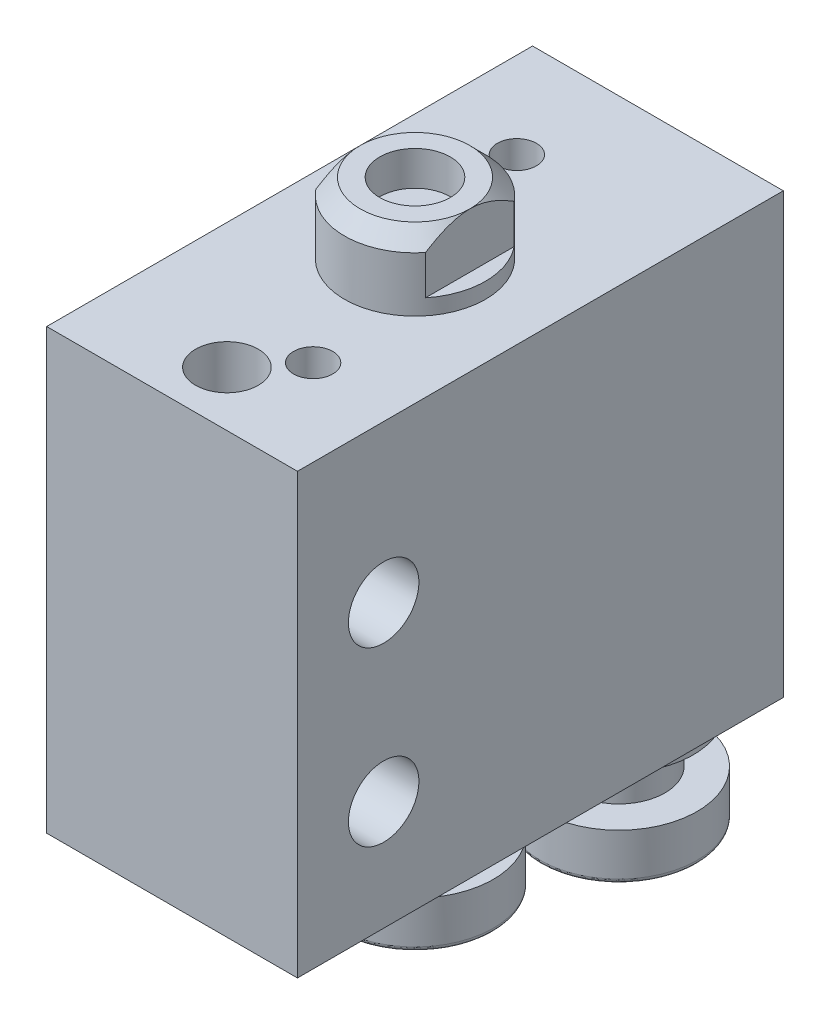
ISO-10303-21;
HEADER;
FILE_DESCRIPTION(('STEP AP214'),'2;1');
FILE_NAME('part.step','',(''),(''),'','','');
FILE_SCHEMA(('AUTOMOTIVE_DESIGN { 1 0 10303 214 1 1 1 1 }'));
ENDSEC;
DATA;
#1=APPLICATION_CONTEXT('core data for automotive mechanical design processes');
#2=APPLICATION_PROTOCOL_DEFINITION('international standard','automotive_design',2000,#1);
#3=PRODUCT_CONTEXT('',#1,'mechanical');
#4=PRODUCT('Part','Part','',(#3));
#5=PRODUCT_RELATED_PRODUCT_CATEGORY('part','',(#4));
#6=PRODUCT_DEFINITION_FORMATION('','',#4);
#7=PRODUCT_DEFINITION_CONTEXT('part definition',#1,'design');
#8=PRODUCT_DEFINITION('design','',#6,#7);
#9=PRODUCT_DEFINITION_SHAPE('','',#8);
#10=(LENGTH_UNIT() NAMED_UNIT(*) SI_UNIT(.MILLI.,.METRE.));
#11=(NAMED_UNIT(*) PLANE_ANGLE_UNIT() SI_UNIT($,.RADIAN.));
#12=(NAMED_UNIT(*) SI_UNIT($,.STERADIAN.) SOLID_ANGLE_UNIT());
#13=UNCERTAINTY_MEASURE_WITH_UNIT(LENGTH_MEASURE(1.E-05),#10,'distance_accuracy_value','');
#14=(GEOMETRIC_REPRESENTATION_CONTEXT(3) GLOBAL_UNCERTAINTY_ASSIGNED_CONTEXT((#13)) GLOBAL_UNIT_ASSIGNED_CONTEXT((#10,
#11,#12)) REPRESENTATION_CONTEXT('',''));
#15=CARTESIAN_POINT('',(0.,0.,0.));
#16=DIRECTION('',(0.,0.,1.));
#17=DIRECTION('',(1.,0.,0.));
#18=AXIS2_PLACEMENT_3D('',#15,#16,#17);
#19=CARTESIAN_POINT('',(0.,30.3,3.5));
#20=DIRECTION('',(0.,-1.,0.));
#21=DIRECTION('',(0.,0.,-1.));
#22=AXIS2_PLACEMENT_3D('',#19,#20,#21);
#23=PLANE('',#22);
#24=CARTESIAN_POINT('',(0.,30.3,0.));
#25=DIRECTION('',(0.,1.,0.));
#26=DIRECTION('',(0.,0.,-1.));
#27=AXIS2_PLACEMENT_3D('',#24,#25,#26);
#28=CIRCLE('',#27,2.24999999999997);
#29=CARTESIAN_POINT('',(-2.24999999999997,30.3,0.));
#30=VERTEX_POINT('',#29);
#31=EDGE_CURVE('E213',#30,#30,#28,.T.);
#32=ORIENTED_EDGE('',*,*,#31,.T.);
#33=EDGE_LOOP('',(#32));
#34=FACE_BOUND('',#33,.T.);
#35=ADVANCED_FACE('F16',(#34),#23,.F.);
#36=CARTESIAN_POINT('',(0.,8.8,0.));
#37=DIRECTION('',(0.,-1.,0.));
#38=DIRECTION('',(0.,0.,-1.));
#39=AXIS2_PLACEMENT_3D('',#36,#37,#38);
#40=PLANE('',#39);
#41=CARTESIAN_POINT('',(0.,8.8,0.));
#42=DIRECTION('',(0.,-1.,0.));
#43=DIRECTION('',(-0.586005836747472,0.,0.810306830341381));
#44=AXIS2_PLACEMENT_3D('',#41,#42,#43);
#45=CIRCLE('',#44,2.);
#46=CARTESIAN_POINT('',(-1.17201167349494,8.8,1.62061366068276));
#47=VERTEX_POINT('',#46);
#48=EDGE_CURVE('E92',#47,#47,#45,.T.);
#49=ORIENTED_EDGE('',*,*,#48,.T.);
#50=EDGE_LOOP('',(#49));
#51=FACE_BOUND('',#50,.T.);
#52=ADVANCED_FACE('F931',(#51),#40,.T.);
#53=CARTESIAN_POINT('',(0.,32.5,3.5));
#54=DIRECTION('',(0.,-1.,0.));
#55=DIRECTION('',(0.,0.,-1.));
#56=AXIS2_PLACEMENT_3D('',#53,#54,#55);
#57=PLANE('',#56);
#58=CARTESIAN_POINT('',(0.,32.5,0.));
#59=DIRECTION('',(0.,1.,0.));
#60=DIRECTION('',(0.,0.,1.));
#61=AXIS2_PLACEMENT_3D('',#58,#59,#60);
#62=CIRCLE('',#61,2.24999999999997);
#63=CARTESIAN_POINT('',(-2.24999999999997,32.5,0.));
#64=VERTEX_POINT('',#63);
#65=EDGE_CURVE('E223',#64,#64,#62,.T.);
#66=ORIENTED_EDGE('',*,*,#65,.F.);
#67=EDGE_LOOP('',(#66));
#68=FACE_BOUND('',#67,.T.);
#69=CARTESIAN_POINT('',(0.,32.5,0.));
#70=DIRECTION('',(0.,1.,0.));
#71=DIRECTION('',(-1.,0.,0.));
#72=AXIS2_PLACEMENT_3D('',#69,#70,#71);
#73=CIRCLE('',#72,3.5);
#74=CARTESIAN_POINT('',(-3.5,32.5,0.));
#75=VERTEX_POINT('',#74);
#76=CARTESIAN_POINT('',(3.5,32.5,0.));
#77=VERTEX_POINT('',#76);
#78=EDGE_CURVE('E29',#75,#77,#73,.T.);
#79=ORIENTED_EDGE('',*,*,#78,.T.);
#80=CARTESIAN_POINT('',(0.,32.5,0.));
#81=DIRECTION('',(0.,1.,0.));
#82=DIRECTION('',(-1.,0.,0.));
#83=AXIS2_PLACEMENT_3D('',#80,#81,#82);
#84=CIRCLE('',#83,3.5);
#85=EDGE_CURVE('E469',#77,#75,#84,.T.);
#86=ORIENTED_EDGE('',*,*,#85,.T.);
#87=EDGE_LOOP('',(#79,#86));
#88=FACE_BOUND('',#87,.T.);
#89=ADVANCED_FACE('F475',(#68,#88),#57,.F.);
#90=CARTESIAN_POINT('',(8.79811795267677,29.,7.28852252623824));
#91=DIRECTION('',(0.,1.,0.));
#92=DIRECTION('',(1.,0.,0.));
#93=AXIS2_PLACEMENT_3D('',#90,#91,#92);
#94=PLANE('',#93);
#95=CARTESIAN_POINT('',(0.,29.,0.));
#96=DIRECTION('',(0.,1.,0.));
#97=DIRECTION('',(-1.,0.,0.));
#98=AXIS2_PLACEMENT_3D('',#95,#96,#97);
#99=CIRCLE('',#98,4.5);
#100=CARTESIAN_POINT('',(3.5,29.,2.8284271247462));
#101=VERTEX_POINT('',#100);
#102=CARTESIAN_POINT('',(3.5,29.,-2.8284271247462));
#103=VERTEX_POINT('',#102);
#104=EDGE_CURVE('E497',#101,#103,#99,.T.);
#105=ORIENTED_EDGE('',*,*,#104,.T.);
#106=DIRECTION('',(0.,0.,1.));
#107=VECTOR('',#106,1.);
#108=CARTESIAN_POINT('',(3.5,29.,7.28852252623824));
#109=LINE('',#108,#107);
#110=EDGE_CURVE('E11',#103,#101,#109,.T.);
#111=ORIENTED_EDGE('',*,*,#110,.T.);
#112=EDGE_LOOP('',(#105,#111));
#113=FACE_BOUND('',#112,.T.);
#114=ADVANCED_FACE('F513',(#113),#94,.T.);
#115=CARTESIAN_POINT('',(3.5,29.,7.28852252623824));
#116=DIRECTION('',(-1.,0.,0.));
#117=DIRECTION('',(0.,1.,0.));
#118=AXIS2_PLACEMENT_3D('',#115,#116,#117);
#119=PLANE('',#118);
#120=ORIENTED_EDGE('',*,*,#110,.F.);
#121=DIRECTION('',(0.,-1.,0.));
#122=VECTOR('',#121,1.);
#123=CARTESIAN_POINT('',(3.5,32.5,-2.8284271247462));
#124=LINE('',#123,#122);
#125=CARTESIAN_POINT('',(3.5,31.5,-2.8284271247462));
#126=VERTEX_POINT('',#125);
#127=EDGE_CURVE('E426',#126,#103,#124,.T.);
#128=ORIENTED_EDGE('',*,*,#127,.F.);
#129=CARTESIAN_POINT('',(3.5,32.5,0.));
#130=CARTESIAN_POINT('',(3.49999835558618,32.5000040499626,-0.0419179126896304));
#131=CARTESIAN_POINT('',(3.49998645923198,32.499260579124,-0.0838359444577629));
#132=CARTESIAN_POINT('',(3.49995768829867,32.4962838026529,-0.167521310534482));
#133=CARTESIAN_POINT('',(3.49994082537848,32.494053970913,-0.209288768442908));
#134=CARTESIAN_POINT('',(3.49991747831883,32.4881053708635,-0.29277819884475));
#135=CARTESIAN_POINT('',(3.49991100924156,32.4843844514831,-0.334500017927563));
#136=CARTESIAN_POINT('',(3.49991180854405,32.4754607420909,-0.418002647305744));
#137=CARTESIAN_POINT('',(3.49991914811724,32.4702503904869,-0.459782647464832));
#138=CARTESIAN_POINT('',(3.49994332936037,32.4583523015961,-0.543504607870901));
#139=CARTESIAN_POINT('',(3.49996025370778,32.4516520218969,-0.585444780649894));
#140=CARTESIAN_POINT('',(3.49998811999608,32.436780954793,-0.669588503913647));
#141=CARTESIAN_POINT('',(3.49999898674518,32.4285932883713,-0.711789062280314));
#142=CARTESIAN_POINT('',(3.50000097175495,32.4112422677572,-0.794185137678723));
#143=CARTESIAN_POINT('',(3.49999288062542,32.4021326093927,-0.834391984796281));
#144=CARTESIAN_POINT('',(3.49997695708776,32.38264488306,-0.914853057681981));
#145=CARTESIAN_POINT('',(3.49996912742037,32.3722568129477,-0.955104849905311));
#146=CARTESIAN_POINT('',(3.49995457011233,32.3389897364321,-1.07678732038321));
#147=CARTESIAN_POINT('',(3.49995736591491,32.3143082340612,-1.1577303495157));
#148=CARTESIAN_POINT('',(3.49997845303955,32.2599620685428,-1.32064929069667));
#149=CARTESIAN_POINT('',(3.49999721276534,32.2301687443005,-1.40258181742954));
#150=CARTESIAN_POINT('',(3.50000248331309,32.170242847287,-1.55610285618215));
#151=CARTESIAN_POINT('',(3.49999228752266,32.1405015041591,-1.62784512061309));
#152=CARTESIAN_POINT('',(3.49997930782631,32.0774457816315,-1.77226454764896));
#153=CARTESIAN_POINT('',(3.49997675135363,32.0440519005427,-1.84490689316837));
#154=CARTESIAN_POINT('',(3.49997704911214,31.9736988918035,-1.99136127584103));
#155=CARTESIAN_POINT('',(3.49998008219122,31.936659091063,-2.06513440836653));
#156=CARTESIAN_POINT('',(3.49998842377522,31.8590122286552,-2.2140541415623));
#157=CARTESIAN_POINT('',(3.4999938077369,31.8183259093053,-2.28915929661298));
#158=CARTESIAN_POINT('',(3.5000008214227,31.7333870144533,-2.44091841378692));
#159=CARTESIAN_POINT('',(3.5000023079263,31.6890586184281,-2.51752977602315));
#160=CARTESIAN_POINT('',(3.5000027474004,31.5968189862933,-2.67244726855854));
#161=CARTESIAN_POINT('',(3.50000160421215,31.5488358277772,-2.75071064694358));
#162=CARTESIAN_POINT('',(3.49999999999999,31.5,-2.8284271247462));
#163=B_SPLINE_CURVE_WITH_KNOTS('',3,(#129,#130,#131,#132,#133,#134,#135,#136,#137,#138,#139,
#140,#141,#142,#143,#144,#145,#146,#147,#148,#149,#150,#151,#152,#153,#154,#155,#156,#157,#158,
#159,#160,#161,#162),.UNSPECIFIED.,.F.,.F.,(4,2,2,2,2,2,2,2,2,2,2,2,2,2,2,2,4),(0.,
0.1257471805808,0.251201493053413,0.376837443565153,0.503122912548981,0.63051467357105,
0.759454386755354,0.883113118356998,1.00780950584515,1.26153430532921,1.52297107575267,
1.75590064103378,1.99569900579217,2.2433037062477,2.49951846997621,2.7650243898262,
3.04039249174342),.UNSPECIFIED.);
#164=EDGE_CURVE('E439',#77,#126,#163,.T.);
#165=ORIENTED_EDGE('',*,*,#164,.F.);
#166=CARTESIAN_POINT('',(3.5,31.5,2.82842712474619));
#167=CARTESIAN_POINT('',(3.50000158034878,31.54871158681,2.75090853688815));
#168=CARTESIAN_POINT('',(3.50000320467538,31.5965744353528,2.67284564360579));
#169=CARTESIAN_POINT('',(3.50000422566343,31.6885941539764,2.51831856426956));
#170=CARTESIAN_POINT('',(3.50000369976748,31.7328223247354,2.44189676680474));
#171=CARTESIAN_POINT('',(3.49999862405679,31.8175813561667,2.29050756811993));
#172=CARTESIAN_POINT('',(3.49999421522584,31.8581873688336,2.21558240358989));
#173=CARTESIAN_POINT('',(3.49998719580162,31.9356943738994,2.06701513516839));
#174=CARTESIAN_POINT('',(3.49998452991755,31.9726739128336,1.99341412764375));
#175=CARTESIAN_POINT('',(3.4999842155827,32.0429269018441,1.84729832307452));
#176=CARTESIAN_POINT('',(3.49998641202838,32.0762803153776,1.77482212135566));
#177=CARTESIAN_POINT('',(3.49999640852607,32.1392765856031,1.6307319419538));
#178=CARTESIAN_POINT('',(3.50000404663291,32.1689982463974,1.55915252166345));
#179=CARTESIAN_POINT('',(3.49999545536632,32.2289194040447,1.40593266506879));
#180=CARTESIAN_POINT('',(3.49997617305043,32.25872756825,1.32413814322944));
#181=CARTESIAN_POINT('',(3.49995682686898,32.3131281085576,1.16147476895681));
#182=CARTESIAN_POINT('',(3.49995621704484,32.3378476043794,1.08064888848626));
#183=CARTESIAN_POINT('',(3.49997218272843,32.3711897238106,0.959136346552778));
#184=CARTESIAN_POINT('',(3.49998017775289,32.3816061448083,0.918936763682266));
#185=CARTESIAN_POINT('',(3.49999518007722,32.4011569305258,0.83857680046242));
#186=CARTESIAN_POINT('',(3.50000219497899,32.410301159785,0.798418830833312));
#187=CARTESIAN_POINT('',(3.49999769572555,32.4277881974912,0.715836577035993));
#188=CARTESIAN_POINT('',(3.49998524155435,32.4360684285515,0.673399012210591));
#189=CARTESIAN_POINT('',(3.49995522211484,32.4511072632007,0.588782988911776));
#190=CARTESIAN_POINT('',(3.49993772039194,32.4578830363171,0.546607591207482));
#191=CARTESIAN_POINT('',(3.49991305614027,32.4699151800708,0.462415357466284));
#192=CARTESIAN_POINT('',(3.49990580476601,32.4751842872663,0.420400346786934));
#193=CARTESIAN_POINT('',(3.49990578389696,32.4842085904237,0.336426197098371));
#194=CARTESIAN_POINT('',(3.49991294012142,32.4879714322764,0.294467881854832));
#195=CARTESIAN_POINT('',(3.49993788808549,32.493987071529,0.210502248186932));
#196=CARTESIAN_POINT('',(3.4999556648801,32.496241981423,0.168495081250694));
#197=CARTESIAN_POINT('',(3.49998588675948,32.4992523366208,0.0843253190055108));
#198=CARTESIAN_POINT('',(3.49999831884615,32.5000041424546,0.0421625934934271));
#199=CARTESIAN_POINT('',(3.5,32.5,0.));
#200=B_SPLINE_CURVE_WITH_KNOTS('',3,(#166,#167,#168,#169,#170,#171,#172,#173,#174,#175,#176,
#177,#178,#179,#180,#181,#182,#183,#184,#185,#186,#187,#188,#189,#190,#191,#192,#193,#194,#195,
#196,#197,#198,#199),.UNSPECIFIED.,.F.,.F.,(4,2,2,2,2,2,2,2,2,2,2,2,2,2,2,2,4),(0.,
0.274667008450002,0.539530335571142,0.795155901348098,1.04221841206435,1.28151375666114,
1.51397003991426,1.77503366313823,2.02845661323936,2.15302278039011,2.27656166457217,
2.40625196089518,2.53437593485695,2.66138243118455,2.78773580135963,2.91391178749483,
3.04039291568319),.UNSPECIFIED.);
#201=CARTESIAN_POINT('',(3.5,31.5,2.8284271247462));
#202=VERTEX_POINT('',#201);
#203=EDGE_CURVE('E350',#202,#77,#200,.T.);
#204=ORIENTED_EDGE('',*,*,#203,.F.);
#205=DIRECTION('',(0.,1.,0.));
#206=VECTOR('',#205,1.);
#207=CARTESIAN_POINT('',(3.5,32.5,2.8284271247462));
#208=LINE('',#207,#206);
#209=EDGE_CURVE('E492',#101,#202,#208,.T.);
#210=ORIENTED_EDGE('',*,*,#209,.F.);
#211=EDGE_LOOP('',(#120,#128,#165,#204,#210));
#212=FACE_BOUND('',#211,.T.);
#213=ADVANCED_FACE('F368',(#212),#119,.F.);
#214=CARTESIAN_POINT('',(0.,31.5,0.));
#215=DIRECTION('',(0.,-1.,0.));
#216=DIRECTION('',(1.,0.,0.));
#217=AXIS2_PLACEMENT_3D('',#214,#215,#216);
#218=CONICAL_SURFACE('',#217,4.5,0.785398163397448);
#219=CARTESIAN_POINT('',(0.,31.5,0.));
#220=DIRECTION('',(0.,1.,0.));
#221=DIRECTION('',(-1.,0.,0.));
#222=AXIS2_PLACEMENT_3D('',#219,#220,#221);
#223=CIRCLE('',#222,4.5);
#224=CARTESIAN_POINT('',(-3.5,31.5,2.8284271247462));
#225=VERTEX_POINT('',#224);
#226=EDGE_CURVE('E496',#225,#202,#223,.T.);
#227=ORIENTED_EDGE('',*,*,#226,.T.);
#228=ORIENTED_EDGE('',*,*,#203,.T.);
#229=ORIENTED_EDGE('',*,*,#78,.F.);
#230=CARTESIAN_POINT('',(-3.5,32.5,0.));
#231=CARTESIAN_POINT('',(-3.49999831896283,32.5000041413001,0.042155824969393));
#232=CARTESIAN_POINT('',(-3.49998618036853,32.4992522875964,0.08431177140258));
#233=CARTESIAN_POINT('',(-3.49995683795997,32.4962419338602,0.16847069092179));
#234=CARTESIAN_POINT('',(-3.4999396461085,32.4939869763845,0.210473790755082));
#235=CARTESIAN_POINT('',(-3.4999158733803,32.487971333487,0.294434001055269));
#236=CARTESIAN_POINT('',(-3.49990930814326,32.4842084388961,0.336390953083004));
#237=CARTESIAN_POINT('',(-3.49991019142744,32.4751841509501,0.420365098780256));
#238=CARTESIAN_POINT('',(-3.49991771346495,32.4699150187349,0.462381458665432));
#239=CARTESIAN_POINT('',(-3.49994243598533,32.4578828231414,0.546579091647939));
#240=CARTESIAN_POINT('',(-3.49995972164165,32.4511069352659,0.588758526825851));
#241=CARTESIAN_POINT('',(-3.49998805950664,32.4360683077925,0.673385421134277));
#242=CARTESIAN_POINT('',(-3.49999903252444,32.4277883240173,0.715829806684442));
#243=CARTESIAN_POINT('',(-3.50000092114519,32.4103051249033,0.798405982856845));
#244=CARTESIAN_POINT('',(-3.49999277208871,32.4011651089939,0.838551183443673));
#245=CARTESIAN_POINT('',(-3.49997690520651,32.3816209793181,0.918890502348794));
#246=CARTESIAN_POINT('',(-3.49996919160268,32.371206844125,0.959082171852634));
#247=CARTESIAN_POINT('',(-3.49995494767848,32.3378672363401,1.08058646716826));
#248=CARTESIAN_POINT('',(-3.49995790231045,32.3131469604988,1.16141171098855));
#249=CARTESIAN_POINT('',(-3.49997888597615,32.2587403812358,1.32409591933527));
#250=CARTESIAN_POINT('',(-3.49999737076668,32.2289259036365,1.40591155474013));
#251=CARTESIAN_POINT('',(-3.50000234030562,32.1690023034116,1.5591461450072));
#252=CARTESIAN_POINT('',(-3.49999211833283,32.1392855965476,1.63071959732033));
#253=CARTESIAN_POINT('',(-3.49997920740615,32.0762968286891,1.77479975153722));
#254=CARTESIAN_POINT('',(-3.49997674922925,32.0429458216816,1.84727183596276));
#255=CARTESIAN_POINT('',(-3.49997717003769,31.972696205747,1.99338196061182));
#256=CARTESIAN_POINT('',(-3.49998022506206,31.9357175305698,2.06698135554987));
#257=CARTESIAN_POINT('',(-3.49998856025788,31.8582105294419,2.21554807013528));
#258=CARTESIAN_POINT('',(-3.4999939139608,31.81760355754,2.29047424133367));
#259=CARTESIAN_POINT('',(-3.50000087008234,31.732840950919,2.44186835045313));
#260=CARTESIAN_POINT('',(-3.50000232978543,31.6886100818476,2.5182940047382));
#261=CARTESIAN_POINT('',(-3.50000273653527,31.5965832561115,2.67283184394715));
#262=CARTESIAN_POINT('',(-3.50000158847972,31.5487159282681,2.75090159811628));
#263=CARTESIAN_POINT('',(-3.5,31.5,2.82842712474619));
#264=B_SPLINE_CURVE_WITH_KNOTS('',3,(#230,#231,#232,#233,#234,#235,#236,#237,#238,#239,#240,
#241,#242,#243,#244,#245,#246,#247,#248,#249,#250,#251,#252,#253,#254,#255,#256,#257,#258,#259,
#260,#261,#262,#263),.UNSPECIFIED.,.F.,.F.,(4,2,2,2,2,2,2,2,2,2,2,2,2,2,2,2,4),(0.,
0.126460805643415,0.252624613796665,0.37897393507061,0.505984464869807,0.634120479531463,
0.76383072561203,0.88732944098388,1.01187087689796,1.26529271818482,1.52642242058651,
1.7588564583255,1.99813750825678,2.2451945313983,2.50082411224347,2.76570151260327,
3.04039308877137),.UNSPECIFIED.);
#265=EDGE_CURVE('E388',#75,#225,#264,.T.);
#266=ORIENTED_EDGE('',*,*,#265,.T.);
#267=EDGE_LOOP('',(#227,#228,#229,#266));
#268=FACE_BOUND('',#267,.T.);
#269=ADVANCED_FACE('F357',(#268),#218,.T.);
#270=CARTESIAN_POINT('',(-3.5,29.,7.28852252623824));
#271=DIRECTION('',(1.,0.,0.));
#272=DIRECTION('',(0.,0.,-1.));
#273=AXIS2_PLACEMENT_3D('',#270,#271,#272);
#274=PLANE('',#273);
#275=DIRECTION('',(0.,0.,-1.));
#276=VECTOR('',#275,1.);
#277=CARTESIAN_POINT('',(-3.5,29.,7.28852252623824));
#278=LINE('',#277,#276);
#279=CARTESIAN_POINT('',(-3.5,29.,2.8284271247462));
#280=VERTEX_POINT('',#279);
#281=CARTESIAN_POINT('',(-3.5,29.,-2.8284271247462));
#282=VERTEX_POINT('',#281);
#283=EDGE_CURVE('E473',#280,#282,#278,.T.);
#284=ORIENTED_EDGE('',*,*,#283,.F.);
#285=DIRECTION('',(0.,-1.,0.));
#286=VECTOR('',#285,1.);
#287=CARTESIAN_POINT('',(-3.5,32.5,2.8284271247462));
#288=LINE('',#287,#286);
#289=EDGE_CURVE('E394',#225,#280,#288,.T.);
#290=ORIENTED_EDGE('',*,*,#289,.F.);
#291=ORIENTED_EDGE('',*,*,#265,.F.);
#292=CARTESIAN_POINT('',(-3.49999999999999,31.5,-2.8284271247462));
#293=CARTESIAN_POINT('',(-3.50000159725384,31.5488321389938,-2.75071654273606));
#294=CARTESIAN_POINT('',(-3.50000314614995,31.5968114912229,-2.67245899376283));
#295=CARTESIAN_POINT('',(-3.50000392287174,31.6890450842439,-2.51755064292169));
#296=CARTESIAN_POINT('',(-3.50000323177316,31.7333711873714,-2.44094255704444));
#297=CARTESIAN_POINT('',(-3.49999781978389,31.8183070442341,-2.28918761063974));
#298=CARTESIAN_POINT('',(-3.49999324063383,31.8589925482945,-2.21408330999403));
#299=CARTESIAN_POINT('',(-3.49998601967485,31.936639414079,-2.06516310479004));
#300=CARTESIAN_POINT('',(-3.49998331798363,31.973679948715,-1.99138860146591));
#301=CARTESIAN_POINT('',(-3.49998311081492,32.0440358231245,-1.84492939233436));
#302=CARTESIAN_POINT('',(-3.49998544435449,32.0774317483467,-1.7722835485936));
#303=CARTESIAN_POINT('',(-3.49999594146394,32.1404938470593,-1.62785560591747));
#304=CARTESIAN_POINT('',(-3.50000393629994,32.1702394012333,-1.55610827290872));
#305=CARTESIAN_POINT('',(-3.49999558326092,32.2301632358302,-1.40259975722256));
#306=CARTESIAN_POINT('',(-3.49997614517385,32.2599512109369,-1.32068517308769));
#307=CARTESIAN_POINT('',(-3.49995645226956,32.3142922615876,-1.15778393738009));
#308=CARTESIAN_POINT('',(-3.49995565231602,32.3389730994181,-1.07684036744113));
#309=CARTESIAN_POINT('',(-3.49997167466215,32.3722423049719,-0.955150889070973));
#310=CARTESIAN_POINT('',(-3.49997974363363,32.3826323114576,-0.914892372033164));
#311=CARTESIAN_POINT('',(-3.49999493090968,32.4021256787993,-0.834413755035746));
#312=CARTESIAN_POINT('',(-3.50000205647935,32.4112389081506,-0.794196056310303));
#313=CARTESIAN_POINT('',(-3.49999785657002,32.4285931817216,-0.711794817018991));
#314=CARTESIAN_POINT('',(-3.49998573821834,32.4367810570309,-0.669600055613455));
#315=CARTESIAN_POINT('',(-3.4999564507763,32.4516522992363,-0.585465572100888));
#316=CARTESIAN_POINT('',(-3.49993934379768,32.4583524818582,-0.543528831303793));
#317=CARTESIAN_POINT('',(-3.49991521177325,32.4702505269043,-0.459811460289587));
#318=CARTESIAN_POINT('',(-3.49990810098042,32.4754608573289,-0.418032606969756));
#319=CARTESIAN_POINT('',(-3.4999080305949,32.4843845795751,-0.334529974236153));
#320=CARTESIAN_POINT('',(-3.49991499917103,32.4881054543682,-0.292806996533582));
#321=CARTESIAN_POINT('',(-3.49993933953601,32.4940540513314,-0.20931295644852));
#322=CARTESIAN_POINT('',(-3.49995669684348,32.4962838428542,-0.167542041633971));
#323=CARTESIAN_POINT('',(-3.49998621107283,32.4992606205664,-0.0838474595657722));
#324=CARTESIAN_POINT('',(-3.49999835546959,32.5000040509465,-0.0419236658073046));
#325=CARTESIAN_POINT('',(-3.5,32.5,0.));
#326=B_SPLINE_CURVE_WITH_KNOTS('',3,(#292,#293,#294,#295,#296,#297,#298,#299,#300,#301,#302,
#303,#304,#305,#306,#307,#308,#309,#310,#311,#312,#313,#314,#315,#316,#317,#318,#319,#320,#321,
#322,#323,#324,#325),.UNSPECIFIED.,.F.,.F.,(4,2,2,2,2,2,2,2,2,2,2,2,2,2,2,2,4),(0.,
0.275347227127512,0.540841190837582,0.797052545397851,1.04466191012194,1.284472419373,
1.51742087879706,1.77880150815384,2.03252724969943,2.15724464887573,2.28093750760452,
2.40986026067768,2.53724178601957,2.66352382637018,2.78916321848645,2.91462788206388,
3.04039233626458),.UNSPECIFIED.);
#327=CARTESIAN_POINT('',(-3.5,31.5,-2.8284271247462));
#328=VERTEX_POINT('',#327);
#329=EDGE_CURVE('E466',#328,#75,#326,.T.);
#330=ORIENTED_EDGE('',*,*,#329,.F.);
#331=DIRECTION('',(0.,1.,0.));
#332=VECTOR('',#331,1.);
#333=CARTESIAN_POINT('',(-3.5,32.5,-2.8284271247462));
#334=LINE('',#333,#332);
#335=EDGE_CURVE('E427',#282,#328,#334,.T.);
#336=ORIENTED_EDGE('',*,*,#335,.F.);
#337=EDGE_LOOP('',(#284,#290,#291,#330,#336));
#338=FACE_BOUND('',#337,.T.);
#339=ADVANCED_FACE('F367',(#338),#274,.F.);
#340=CARTESIAN_POINT('',(-3.5,29.,-6.58524305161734));
#341=DIRECTION('',(0.,1.,0.));
#342=DIRECTION('',(1.,0.,0.));
#343=AXIS2_PLACEMENT_3D('',#340,#341,#342);
#344=PLANE('',#343);
#345=CARTESIAN_POINT('',(0.,29.,0.));
#346=DIRECTION('',(0.,1.,0.));
#347=DIRECTION('',(-1.,0.,0.));
#348=AXIS2_PLACEMENT_3D('',#345,#346,#347);
#349=CIRCLE('',#348,4.5);
#350=EDGE_CURVE('E309',#282,#280,#349,.T.);
#351=ORIENTED_EDGE('',*,*,#350,.T.);
#352=ORIENTED_EDGE('',*,*,#283,.T.);
#353=EDGE_LOOP('',(#351,#352));
#354=FACE_BOUND('',#353,.T.);
#355=ADVANCED_FACE('F404',(#354),#344,.T.);
#356=CARTESIAN_POINT('',(0.,31.5,0.));
#357=DIRECTION('',(0.,-1.,0.));
#358=DIRECTION('',(1.,0.,0.));
#359=AXIS2_PLACEMENT_3D('',#356,#357,#358);
#360=CONICAL_SURFACE('',#359,4.5,0.785398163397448);
#361=ORIENTED_EDGE('',*,*,#85,.F.);
#362=ORIENTED_EDGE('',*,*,#164,.T.);
#363=CARTESIAN_POINT('',(0.,31.5,0.));
#364=DIRECTION('',(0.,1.,0.));
#365=DIRECTION('',(-1.,0.,0.));
#366=AXIS2_PLACEMENT_3D('',#363,#364,#365);
#367=CIRCLE('',#366,4.5);
#368=EDGE_CURVE('E417',#126,#328,#367,.T.);
#369=ORIENTED_EDGE('',*,*,#368,.T.);
#370=ORIENTED_EDGE('',*,*,#329,.T.);
#371=EDGE_LOOP('',(#361,#362,#369,#370));
#372=FACE_BOUND('',#371,.T.);
#373=ADVANCED_FACE('F445',(#372),#360,.T.);
#374=CARTESIAN_POINT('',(0.,28.,0.));
#375=DIRECTION('',(0.,1.,0.));
#376=DIRECTION('',(1.,0.,0.));
#377=AXIS2_PLACEMENT_3D('',#374,#375,#376);
#378=PLANE('',#377);
#379=CARTESIAN_POINT('',(0.,28.,12.));
#380=DIRECTION('',(0.,1.,0.));
#381=DIRECTION('',(0.,0.,1.));
#382=AXIS2_PLACEMENT_3D('',#379,#380,#381);
#383=CIRCLE('',#382,2.);
#384=CARTESIAN_POINT('',(0.,28.,14.));
#385=VERTEX_POINT('',#384);
#386=EDGE_CURVE('E280',#385,#385,#383,.T.);
#387=ORIENTED_EDGE('',*,*,#386,.F.);
#388=EDGE_LOOP('',(#387));
#389=FACE_BOUND('',#388,.T.);
#390=CARTESIAN_POINT('',(-2.5,28.,-9.));
#391=DIRECTION('',(0.,1.,0.));
#392=DIRECTION('',(0.,0.,1.));
#393=AXIS2_PLACEMENT_3D('',#390,#391,#392);
#394=CIRCLE('',#393,1.25);
#395=CARTESIAN_POINT('',(-2.5,28.,-7.75));
#396=VERTEX_POINT('',#395);
#397=EDGE_CURVE('E281',#396,#396,#394,.T.);
#398=ORIENTED_EDGE('',*,*,#397,.F.);
#399=EDGE_LOOP('',(#398));
#400=FACE_BOUND('',#399,.T.);
#401=CARTESIAN_POINT('',(2.5,28.,9.));
#402=DIRECTION('',(0.,1.,0.));
#403=DIRECTION('',(0.,0.,1.));
#404=AXIS2_PLACEMENT_3D('',#401,#402,#403);
#405=CIRCLE('',#404,1.25);
#406=CARTESIAN_POINT('',(2.5,28.,10.25));
#407=VERTEX_POINT('',#406);
#408=EDGE_CURVE('E572',#407,#407,#405,.T.);
#409=ORIENTED_EDGE('',*,*,#408,.F.);
#410=EDGE_LOOP('',(#409));
#411=FACE_BOUND('',#410,.T.);
#412=CARTESIAN_POINT('',(0.,28.,0.));
#413=DIRECTION('',(0.,1.,0.));
#414=DIRECTION('',(-1.,0.,0.));
#415=AXIS2_PLACEMENT_3D('',#412,#413,#414);
#416=CIRCLE('',#415,4.5);
#417=CARTESIAN_POINT('',(4.5,28.,0.));
#418=VERTEX_POINT('',#417);
#419=EDGE_CURVE('E306',#418,#418,#416,.T.);
#420=ORIENTED_EDGE('',*,*,#419,.F.);
#421=EDGE_LOOP('',(#420));
#422=FACE_BOUND('',#421,.T.);
#423=DIRECTION('',(-1.,0.,0.));
#424=VECTOR('',#423,1.);
#425=CARTESIAN_POINT('',(8.,28.,-15.5));
#426=LINE('',#425,#424);
#427=CARTESIAN_POINT('',(8.,28.,-15.5));
#428=VERTEX_POINT('',#427);
#429=CARTESIAN_POINT('',(-8.,28.,-15.5));
#430=VERTEX_POINT('',#429);
#431=EDGE_CURVE('E305',#428,#430,#426,.T.);
#432=ORIENTED_EDGE('',*,*,#431,.T.);
#433=DIRECTION('',(0.,0.,-1.));
#434=VECTOR('',#433,1.);
#435=CARTESIAN_POINT('',(-8.,28.,15.5));
#436=LINE('',#435,#434);
#437=CARTESIAN_POINT('',(-8.,28.,15.5));
#438=VERTEX_POINT('',#437);
#439=EDGE_CURVE('E269',#438,#430,#436,.T.);
#440=ORIENTED_EDGE('',*,*,#439,.F.);
#441=DIRECTION('',(-1.,0.,0.));
#442=VECTOR('',#441,1.);
#443=CARTESIAN_POINT('',(8.,28.,15.5));
#444=LINE('',#443,#442);
#445=CARTESIAN_POINT('',(8.,28.,15.5));
#446=VERTEX_POINT('',#445);
#447=EDGE_CURVE('E272',#446,#438,#444,.T.);
#448=ORIENTED_EDGE('',*,*,#447,.F.);
#449=DIRECTION('',(0.,0.,-1.));
#450=VECTOR('',#449,1.);
#451=CARTESIAN_POINT('',(8.,28.,15.5));
#452=LINE('',#451,#450);
#453=EDGE_CURVE('E290',#446,#428,#452,.T.);
#454=ORIENTED_EDGE('',*,*,#453,.T.);
#455=EDGE_LOOP('',(#432,#440,#448,#454));
#456=FACE_BOUND('',#455,.T.);
#457=ADVANCED_FACE('F454',(#389,#400,#411,#422,#456),#378,.T.);
#458=CARTESIAN_POINT('',(-8.,0.,-15.5));
#459=DIRECTION('',(0.,0.,1.));
#460=DIRECTION('',(1.,0.,0.));
#461=AXIS2_PLACEMENT_3D('',#458,#459,#460);
#462=PLANE('',#461);
#463=DIRECTION('',(1.,0.,0.));
#464=VECTOR('',#463,1.);
#465=CARTESIAN_POINT('',(8.,0.,-15.5));
#466=LINE('',#465,#464);
#467=CARTESIAN_POINT('',(-8.,0.,-15.5));
#468=VERTEX_POINT('',#467);
#469=CARTESIAN_POINT('',(8.,0.,-15.5));
#470=VERTEX_POINT('',#469);
#471=EDGE_CURVE('E331',#468,#470,#466,.T.);
#472=ORIENTED_EDGE('',*,*,#471,.F.);
#473=DIRECTION('',(0.,-1.,0.));
#474=VECTOR('',#473,1.);
#475=CARTESIAN_POINT('',(-8.,28.,-15.5));
#476=LINE('',#475,#474);
#477=EDGE_CURVE('E276',#430,#468,#476,.T.);
#478=ORIENTED_EDGE('',*,*,#477,.F.);
#479=ORIENTED_EDGE('',*,*,#431,.F.);
#480=DIRECTION('',(0.,1.,0.));
#481=VECTOR('',#480,1.);
#482=CARTESIAN_POINT('',(8.,0.,-15.5));
#483=LINE('',#482,#481);
#484=EDGE_CURVE('E294',#470,#428,#483,.T.);
#485=ORIENTED_EDGE('',*,*,#484,.F.);
#486=EDGE_LOOP('',(#472,#478,#479,#485));
#487=FACE_BOUND('',#486,.T.);
#488=ADVANCED_FACE('F369',(#487),#462,.F.);
#489=CARTESIAN_POINT('',(-8.,0.,15.5));
#490=DIRECTION('',(0.,0.,1.));
#491=DIRECTION('',(1.,0.,0.));
#492=AXIS2_PLACEMENT_3D('',#489,#490,#491);
#493=PLANE('',#492);
#494=DIRECTION('',(1.,0.,0.));
#495=VECTOR('',#494,1.);
#496=CARTESIAN_POINT('',(8.,0.,15.5));
#497=LINE('',#496,#495);
#498=CARTESIAN_POINT('',(-8.,0.,15.5));
#499=VERTEX_POINT('',#498);
#500=CARTESIAN_POINT('',(8.,0.,15.5));
#501=VERTEX_POINT('',#500);
#502=EDGE_CURVE('E319',#499,#501,#497,.T.);
#503=ORIENTED_EDGE('',*,*,#502,.T.);
#504=DIRECTION('',(0.,1.,0.));
#505=VECTOR('',#504,1.);
#506=CARTESIAN_POINT('',(8.,0.,15.5));
#507=LINE('',#506,#505);
#508=EDGE_CURVE('E284',#501,#446,#507,.T.);
#509=ORIENTED_EDGE('',*,*,#508,.T.);
#510=ORIENTED_EDGE('',*,*,#447,.T.);
#511=DIRECTION('',(0.,-1.,0.));
#512=VECTOR('',#511,1.);
#513=CARTESIAN_POINT('',(-8.,28.,15.5));
#514=LINE('',#513,#512);
#515=EDGE_CURVE('E273',#438,#499,#514,.T.);
#516=ORIENTED_EDGE('',*,*,#515,.T.);
#517=EDGE_LOOP('',(#503,#509,#510,#516));
#518=FACE_BOUND('',#517,.T.);
#519=ADVANCED_FACE('F455',(#518),#493,.T.);
#520=CARTESIAN_POINT('',(-8.,28.,15.5));
#521=DIRECTION('',(1.,0.,0.));
#522=DIRECTION('',(0.,1.,0.));
#523=AXIS2_PLACEMENT_3D('',#520,#521,#522);
#524=PLANE('',#523);
#525=CARTESIAN_POINT('',(-8.,18.,10.));
#526=DIRECTION('',(1.,0.,0.));
#527=DIRECTION('',(0.,0.,-1.));
#528=AXIS2_PLACEMENT_3D('',#525,#526,#527);
#529=CIRCLE('',#528,2.25);
#530=CARTESIAN_POINT('',(-8.,18.,7.75));
#531=VERTEX_POINT('',#530);
#532=EDGE_CURVE('E598',#531,#531,#529,.T.);
#533=ORIENTED_EDGE('',*,*,#532,.T.);
#534=EDGE_LOOP('',(#533));
#535=FACE_BOUND('',#534,.T.);
#536=CARTESIAN_POINT('',(-8.,7.,10.));
#537=DIRECTION('',(1.,0.,0.));
#538=DIRECTION('',(0.,0.,-1.));
#539=AXIS2_PLACEMENT_3D('',#536,#537,#538);
#540=CIRCLE('',#539,2.25);
#541=CARTESIAN_POINT('',(-8.,7.,7.75));
#542=VERTEX_POINT('',#541);
#543=EDGE_CURVE('E327',#542,#542,#540,.T.);
#544=ORIENTED_EDGE('',*,*,#543,.T.);
#545=EDGE_LOOP('',(#544));
#546=FACE_BOUND('',#545,.T.);
#547=ORIENTED_EDGE('',*,*,#477,.T.);
#548=DIRECTION('',(0.,0.,-1.));
#549=VECTOR('',#548,1.);
#550=CARTESIAN_POINT('',(-8.,0.,15.5));
#551=LINE('',#550,#549);
#552=EDGE_CURVE('E323',#499,#468,#551,.T.);
#553=ORIENTED_EDGE('',*,*,#552,.F.);
#554=ORIENTED_EDGE('',*,*,#515,.F.);
#555=ORIENTED_EDGE('',*,*,#439,.T.);
#556=EDGE_LOOP('',(#547,#553,#554,#555));
#557=FACE_BOUND('',#556,.T.);
#558=ADVANCED_FACE('F862',(#535,#546,#557),#524,.F.);
#559=CARTESIAN_POINT('',(8.,0.,15.5));
#560=DIRECTION('',(-1.,0.,0.));
#561=DIRECTION('',(0.,0.,1.));
#562=AXIS2_PLACEMENT_3D('',#559,#560,#561);
#563=PLANE('',#562);
#564=CARTESIAN_POINT('',(8.,18.,10.));
#565=DIRECTION('',(1.,0.,0.));
#566=DIRECTION('',(0.,0.,-1.));
#567=AXIS2_PLACEMENT_3D('',#564,#565,#566);
#568=CIRCLE('',#567,2.25);
#569=CARTESIAN_POINT('',(8.,18.,7.75));
#570=VERTEX_POINT('',#569);
#571=EDGE_CURVE('E289',#570,#570,#568,.T.);
#572=ORIENTED_EDGE('',*,*,#571,.F.);
#573=EDGE_LOOP('',(#572));
#574=FACE_BOUND('',#573,.T.);
#575=CARTESIAN_POINT('',(8.,7.,10.));
#576=DIRECTION('',(1.,0.,0.));
#577=DIRECTION('',(0.,0.,-1.));
#578=AXIS2_PLACEMENT_3D('',#575,#576,#577);
#579=CIRCLE('',#578,2.25);
#580=CARTESIAN_POINT('',(8.,7.,7.75));
#581=VERTEX_POINT('',#580);
#582=EDGE_CURVE('E595',#581,#581,#579,.T.);
#583=ORIENTED_EDGE('',*,*,#582,.F.);
#584=EDGE_LOOP('',(#583));
#585=FACE_BOUND('',#584,.T.);
#586=ORIENTED_EDGE('',*,*,#484,.T.);
#587=ORIENTED_EDGE('',*,*,#453,.F.);
#588=ORIENTED_EDGE('',*,*,#508,.F.);
#589=DIRECTION('',(0.,0.,-1.));
#590=VECTOR('',#589,1.);
#591=CARTESIAN_POINT('',(8.,0.,15.5));
#592=LINE('',#591,#590);
#593=EDGE_CURVE('E324',#501,#470,#592,.T.);
#594=ORIENTED_EDGE('',*,*,#593,.T.);
#595=EDGE_LOOP('',(#586,#587,#588,#594));
#596=FACE_BOUND('',#595,.T.);
#597=ADVANCED_FACE('F853',(#574,#585,#596),#563,.F.);
#598=CARTESIAN_POINT('',(8.,0.,15.5));
#599=DIRECTION('',(0.,1.,0.));
#600=DIRECTION('',(1.,0.,0.));
#601=AXIS2_PLACEMENT_3D('',#598,#599,#600);
#602=PLANE('',#601);
#603=CARTESIAN_POINT('',(2.75,0.,-10.25));
#604=DIRECTION('',(0.,1.,0.));
#605=DIRECTION('',(0.,0.,1.));
#606=AXIS2_PLACEMENT_3D('',#603,#604,#605);
#607=CIRCLE('',#606,4.75);
#608=CARTESIAN_POINT('',(5.5335277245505,0.,-14.0989574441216));
#609=VERTEX_POINT('',#608);
#610=EDGE_CURVE('E302',#609,#609,#607,.T.);
#611=ORIENTED_EDGE('',*,*,#610,.T.);
#612=EDGE_LOOP('',(#611));
#613=FACE_BOUND('',#612,.T.);
#614=CARTESIAN_POINT('',(0.,0.,0.));
#615=DIRECTION('',(0.,1.,0.));
#616=DIRECTION('',(0.,0.,1.));
#617=AXIS2_PLACEMENT_3D('',#614,#615,#616);
#618=CIRCLE('',#617,4.75);
#619=CARTESIAN_POINT('',(2.7835277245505,0.,-3.84895744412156));
#620=VERTEX_POINT('',#619);
#621=EDGE_CURVE('E335',#620,#620,#618,.T.);
#622=ORIENTED_EDGE('',*,*,#621,.T.);
#623=EDGE_LOOP('',(#622));
#624=FACE_BOUND('',#623,.T.);
#625=ORIENTED_EDGE('',*,*,#471,.T.);
#626=ORIENTED_EDGE('',*,*,#593,.F.);
#627=ORIENTED_EDGE('',*,*,#502,.F.);
#628=ORIENTED_EDGE('',*,*,#552,.T.);
#629=EDGE_LOOP('',(#625,#626,#627,#628));
#630=FACE_BOUND('',#629,.T.);
#631=ADVANCED_FACE('F848',(#613,#624,#630),#602,.F.);
#632=CARTESIAN_POINT('',(2.75,8.8,-10.25));
#633=DIRECTION('',(0.,-1.,0.));
#634=DIRECTION('',(0.,0.,-1.));
#635=AXIS2_PLACEMENT_3D('',#632,#633,#634);
#636=PLANE('',#635);
#637=CARTESIAN_POINT('',(2.75,8.8,-10.25));
#638=DIRECTION('',(0.,-1.,0.));
#639=DIRECTION('',(-0.586005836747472,0.,0.810306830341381));
#640=AXIS2_PLACEMENT_3D('',#637,#638,#639);
#641=CIRCLE('',#640,2.);
#642=CARTESIAN_POINT('',(1.57798832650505,8.8,-8.62938633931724));
#643=VERTEX_POINT('',#642);
#644=EDGE_CURVE('E285',#643,#643,#641,.T.);
#645=ORIENTED_EDGE('',*,*,#644,.T.);
#646=EDGE_LOOP('',(#645));
#647=FACE_BOUND('',#646,.T.);
#648=ADVANCED_FACE('F852',(#647),#636,.T.);
#649=CARTESIAN_POINT('',(2.75,-3.8,-10.25));
#650=DIRECTION('',(0.,-1.,0.));
#651=DIRECTION('',(0.,0.,-1.));
#652=AXIS2_PLACEMENT_3D('',#649,#650,#651);
#653=PLANE('',#652);
#654=CARTESIAN_POINT('',(2.75,-3.8,-10.25));
#655=DIRECTION('',(0.,-1.,0.));
#656=DIRECTION('',(-0.586005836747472,0.,0.810306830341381));
#657=AXIS2_PLACEMENT_3D('',#654,#655,#656);
#658=CIRCLE('',#657,2.95);
#659=CARTESIAN_POINT('',(4.47871721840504,-3.8,-12.6404051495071));
#660=VERTEX_POINT('',#659);
#661=EDGE_CURVE('E298',#660,#660,#658,.T.);
#662=ORIENTED_EDGE('',*,*,#661,.T.);
#663=EDGE_LOOP('',(#662));
#664=FACE_BOUND('',#663,.T.);
#665=CARTESIAN_POINT('',(2.75,-3.8,-10.25));
#666=DIRECTION('',(0.,-1.,0.));
#667=DIRECTION('',(-0.586005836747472,0.,0.810306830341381));
#668=AXIS2_PLACEMENT_3D('',#665,#666,#667);
#669=CIRCLE('',#668,5.);
#670=CARTESIAN_POINT('',(5.68002918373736,-3.8,-14.3015341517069));
#671=VERTEX_POINT('',#670);
#672=EDGE_CURVE('E295',#671,#671,#669,.T.);
#673=ORIENTED_EDGE('',*,*,#672,.F.);
#674=EDGE_LOOP('',(#673));
#675=FACE_BOUND('',#674,.T.);
#676=ADVANCED_FACE('F408',(#664,#675),#653,.F.);
#677=CARTESIAN_POINT('',(2.75,-6.8,-10.25));
#678=DIRECTION('',(0.,-1.,0.));
#679=DIRECTION('',(0.,0.,-1.));
#680=AXIS2_PLACEMENT_3D('',#677,#678,#679);
#681=PLANE('',#680);
#682=CARTESIAN_POINT('',(2.75,-6.8,-10.25));
#683=DIRECTION('',(0.,-1.,0.));
#684=DIRECTION('',(-0.586005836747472,0.,0.810306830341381));
#685=AXIS2_PLACEMENT_3D('',#682,#683,#684);
#686=CIRCLE('',#685,2.);
#687=CARTESIAN_POINT('',(1.57798832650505,-6.8,-8.62938633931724));
#688=VERTEX_POINT('',#687);
#689=EDGE_CURVE('E288',#688,#688,#686,.T.);
#690=ORIENTED_EDGE('',*,*,#689,.F.);
#691=EDGE_LOOP('',(#690));
#692=FACE_BOUND('',#691,.T.);
#693=CARTESIAN_POINT('',(2.75,-6.8,-10.25));
#694=DIRECTION('',(0.,-1.,0.));
#695=DIRECTION('',(-0.586005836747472,0.,0.810306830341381));
#696=AXIS2_PLACEMENT_3D('',#693,#694,#695);
#697=CIRCLE('',#696,4.7);
#698=CARTESIAN_POINT('',(-0.00422743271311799,-6.8,-6.44155789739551));
#699=VERTEX_POINT('',#698);
#700=EDGE_CURVE('E299',#699,#699,#697,.T.);
#701=ORIENTED_EDGE('',*,*,#700,.T.);
#702=EDGE_LOOP('',(#701));
#703=FACE_BOUND('',#702,.T.);
#704=ADVANCED_FACE('F842',(#692,#703),#681,.T.);
#705=CARTESIAN_POINT('',(2.75,-0.8,-10.25));
#706=DIRECTION('',(0.,-1.,0.));
#707=DIRECTION('',(0.,0.,-1.));
#708=AXIS2_PLACEMENT_3D('',#705,#706,#707);
#709=PLANE('',#708);
#710=CARTESIAN_POINT('',(2.75,-0.8,-10.25));
#711=DIRECTION('',(0.,-1.,0.));
#712=DIRECTION('',(-0.586005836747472,0.,0.810306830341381));
#713=AXIS2_PLACEMENT_3D('',#710,#711,#712);
#714=CIRCLE('',#713,2.95);
#715=CARTESIAN_POINT('',(4.47871721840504,-0.8,-12.6404051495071));
#716=VERTEX_POINT('',#715);
#717=EDGE_CURVE('E310',#716,#716,#714,.T.);
#718=ORIENTED_EDGE('',*,*,#717,.F.);
#719=EDGE_LOOP('',(#718));
#720=FACE_BOUND('',#719,.T.);
#721=CARTESIAN_POINT('',(2.75,-0.8,-10.25));
#722=DIRECTION('',(0.,-1.,0.));
#723=DIRECTION('',(-0.586005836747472,0.,0.810306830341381));
#724=AXIS2_PLACEMENT_3D('',#721,#722,#723);
#725=CIRCLE('',#724,4.75);
#726=CARTESIAN_POINT('',(5.5335277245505,-0.8,-14.0989574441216));
#727=VERTEX_POINT('',#726);
#728=EDGE_CURVE('E314',#727,#727,#725,.T.);
#729=ORIENTED_EDGE('',*,*,#728,.T.);
#730=EDGE_LOOP('',(#729));
#731=FACE_BOUND('',#730,.T.);
#732=ADVANCED_FACE('F834',(#720,#731),#709,.T.);
#733=CARTESIAN_POINT('',(0.,-3.8,0.));
#734=DIRECTION('',(0.,-1.,0.));
#735=DIRECTION('',(0.,0.,-1.));
#736=AXIS2_PLACEMENT_3D('',#733,#734,#735);
#737=PLANE('',#736);
#738=CARTESIAN_POINT('',(0.,-3.8,0.));
#739=DIRECTION('',(0.,-1.,0.));
#740=DIRECTION('',(-0.586005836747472,0.,0.810306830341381));
#741=AXIS2_PLACEMENT_3D('',#738,#739,#740);
#742=CIRCLE('',#741,2.95);
#743=CARTESIAN_POINT('',(1.72871721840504,-3.8,-2.39040514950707));
#744=VERTEX_POINT('',#743);
#745=EDGE_CURVE('E252',#744,#744,#742,.T.);
#746=ORIENTED_EDGE('',*,*,#745,.T.);
#747=EDGE_LOOP('',(#746));
#748=FACE_BOUND('',#747,.T.);
#749=CARTESIAN_POINT('',(0.,-3.8,0.));
#750=DIRECTION('',(0.,-1.,0.));
#751=DIRECTION('',(-0.586005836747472,0.,0.810306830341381));
#752=AXIS2_PLACEMENT_3D('',#749,#750,#751);
#753=CIRCLE('',#752,5.);
#754=CARTESIAN_POINT('',(2.93002918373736,-3.8,-4.05153415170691));
#755=VERTEX_POINT('',#754);
#756=EDGE_CURVE('E247',#755,#755,#753,.T.);
#757=ORIENTED_EDGE('',*,*,#756,.F.);
#758=EDGE_LOOP('',(#757));
#759=FACE_BOUND('',#758,.T.);
#760=ADVANCED_FACE('F829',(#748,#759),#737,.F.);
#761=CARTESIAN_POINT('',(0.,-6.8,0.));
#762=DIRECTION('',(0.,-1.,0.));
#763=DIRECTION('',(0.,0.,-1.));
#764=AXIS2_PLACEMENT_3D('',#761,#762,#763);
#765=PLANE('',#764);
#766=CARTESIAN_POINT('',(0.,-6.8,0.));
#767=DIRECTION('',(0.,-1.,0.));
#768=DIRECTION('',(-0.586005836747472,0.,0.810306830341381));
#769=AXIS2_PLACEMENT_3D('',#766,#767,#768);
#770=CIRCLE('',#769,2.);
#771=CARTESIAN_POINT('',(-1.17201167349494,-6.8,1.62061366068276));
#772=VERTEX_POINT('',#771);
#773=EDGE_CURVE('E77',#772,#772,#770,.T.);
#774=ORIENTED_EDGE('',*,*,#773,.F.);
#775=EDGE_LOOP('',(#774));
#776=FACE_BOUND('',#775,.T.);
#777=CARTESIAN_POINT('',(0.,-6.8,0.));
#778=DIRECTION('',(0.,-1.,0.));
#779=DIRECTION('',(-0.586005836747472,0.,0.810306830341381));
#780=AXIS2_PLACEMENT_3D('',#777,#778,#779);
#781=CIRCLE('',#780,4.7);
#782=CARTESIAN_POINT('',(-2.75422743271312,-6.8,3.80844210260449));
#783=VERTEX_POINT('',#782);
#784=EDGE_CURVE('E253',#783,#783,#781,.T.);
#785=ORIENTED_EDGE('',*,*,#784,.T.);
#786=EDGE_LOOP('',(#785));
#787=FACE_BOUND('',#786,.T.);
#788=ADVANCED_FACE('F833',(#776,#787),#765,.T.);
#789=CARTESIAN_POINT('',(0.,-0.8,0.));
#790=DIRECTION('',(0.,-1.,0.));
#791=DIRECTION('',(0.,0.,-1.));
#792=AXIS2_PLACEMENT_3D('',#789,#790,#791);
#793=PLANE('',#792);
#794=CARTESIAN_POINT('',(0.,-0.8,0.));
#795=DIRECTION('',(0.,-1.,0.));
#796=DIRECTION('',(-0.586005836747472,0.,0.810306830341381));
#797=AXIS2_PLACEMENT_3D('',#794,#795,#796);
#798=CIRCLE('',#797,2.95);
#799=CARTESIAN_POINT('',(1.72871721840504,-0.8,-2.39040514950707));
#800=VERTEX_POINT('',#799);
#801=EDGE_CURVE('E260',#800,#800,#798,.T.);
#802=ORIENTED_EDGE('',*,*,#801,.F.);
#803=EDGE_LOOP('',(#802));
#804=FACE_BOUND('',#803,.T.);
#805=CARTESIAN_POINT('',(0.,-0.8,0.));
#806=DIRECTION('',(0.,-1.,0.));
#807=DIRECTION('',(-0.586005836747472,0.,0.810306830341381));
#808=AXIS2_PLACEMENT_3D('',#805,#806,#807);
#809=CIRCLE('',#808,4.75);
#810=CARTESIAN_POINT('',(2.7835277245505,-0.8,-3.84895744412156));
#811=VERTEX_POINT('',#810);
#812=EDGE_CURVE('E339',#811,#811,#809,.T.);
#813=ORIENTED_EDGE('',*,*,#812,.T.);
#814=EDGE_LOOP('',(#813));
#815=FACE_BOUND('',#814,.T.);
#816=ADVANCED_FACE('F873',(#804,#815),#793,.T.);
#817=CARTESIAN_POINT('',(0.,-0.8,0.));
#818=DIRECTION('',(0.,1.,0.));
#819=DIRECTION('',(0.586005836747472,0.,-0.810306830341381));
#820=AXIS2_PLACEMENT_3D('',#817,#818,#819);
#821=CYLINDRICAL_SURFACE('',#820,4.75);
#822=ORIENTED_EDGE('',*,*,#621,.F.);
#823=EDGE_LOOP('',(#822));
#824=FACE_BOUND('',#823,.T.);
#825=ORIENTED_EDGE('',*,*,#812,.F.);
#826=EDGE_LOOP('',(#825));
#827=FACE_BOUND('',#826,.T.);
#828=ADVANCED_FACE('F868',(#824,#827),#821,.T.);
#829=CARTESIAN_POINT('',(0.,-3.8,0.));
#830=DIRECTION('',(0.,1.,0.));
#831=DIRECTION('',(0.586005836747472,0.,-0.810306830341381));
#832=AXIS2_PLACEMENT_3D('',#829,#830,#831);
#833=CYLINDRICAL_SURFACE('',#832,2.95);
#834=ORIENTED_EDGE('',*,*,#801,.T.);
#835=EDGE_LOOP('',(#834));
#836=FACE_BOUND('',#835,.T.);
#837=ORIENTED_EDGE('',*,*,#745,.F.);
#838=EDGE_LOOP('',(#837));
#839=FACE_BOUND('',#838,.T.);
#840=ADVANCED_FACE('F872',(#836,#839),#833,.T.);
#841=CARTESIAN_POINT('',(0.,-6.8,0.));
#842=DIRECTION('',(0.,1.,0.));
#843=DIRECTION('',(0.586005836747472,0.,-0.810306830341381));
#844=AXIS2_PLACEMENT_3D('',#841,#842,#843);
#845=CYLINDRICAL_SURFACE('',#844,5.);
#846=ORIENTED_EDGE('',*,*,#756,.T.);
#847=EDGE_LOOP('',(#846));
#848=FACE_BOUND('',#847,.T.);
#849=CARTESIAN_POINT('',(0.,-6.5,0.));
#850=DIRECTION('',(0.,1.,0.));
#851=DIRECTION('',(-0.586005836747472,0.,0.810306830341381));
#852=AXIS2_PLACEMENT_3D('',#849,#850,#851);
#853=CIRCLE('',#852,5.);
#854=CARTESIAN_POINT('',(-2.93002918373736,-6.5,4.05153415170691));
#855=VERTEX_POINT('',#854);
#856=EDGE_CURVE('E263',#855,#855,#853,.T.);
#857=ORIENTED_EDGE('',*,*,#856,.T.);
#858=EDGE_LOOP('',(#857));
#859=FACE_BOUND('',#858,.T.);
#860=ADVANCED_FACE('F248',(#848,#859),#845,.T.);
#861=CARTESIAN_POINT('',(0.,-6.5,0.));
#862=DIRECTION('',(0.,-1.,0.));
#863=DIRECTION('',(-0.586005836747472,0.,0.810306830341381));
#864=AXIS2_PLACEMENT_3D('',#861,#862,#863);
#865=TOROIDAL_SURFACE('',#864,4.7,0.3);
#866=ORIENTED_EDGE('',*,*,#784,.F.);
#867=EDGE_LOOP('',(#866));
#868=FACE_BOUND('',#867,.T.);
#869=ORIENTED_EDGE('',*,*,#856,.F.);
#870=EDGE_LOOP('',(#869));
#871=FACE_BOUND('',#870,.T.);
#872=ADVANCED_FACE('F515',(#868,#871),#865,.T.);
#873=CARTESIAN_POINT('',(0.,8.8,0.));
#874=DIRECTION('',(0.,-1.,0.));
#875=DIRECTION('',(-0.586005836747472,0.,0.810306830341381));
#876=AXIS2_PLACEMENT_3D('',#873,#874,#875);
#877=CYLINDRICAL_SURFACE('',#876,2.);
#878=ORIENTED_EDGE('',*,*,#773,.T.);
#879=EDGE_LOOP('',(#878));
#880=FACE_BOUND('',#879,.T.);
#881=ORIENTED_EDGE('',*,*,#48,.F.);
#882=EDGE_LOOP('',(#881));
#883=FACE_BOUND('',#882,.T.);
#884=ADVANCED_FACE('F771',(#880,#883),#877,.F.);
#885=CARTESIAN_POINT('',(2.75,-0.8,-10.25));
#886=DIRECTION('',(0.,1.,0.));
#887=DIRECTION('',(0.586005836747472,0.,-0.810306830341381));
#888=AXIS2_PLACEMENT_3D('',#885,#886,#887);
#889=CYLINDRICAL_SURFACE('',#888,4.75);
#890=ORIENTED_EDGE('',*,*,#610,.F.);
#891=EDGE_LOOP('',(#890));
#892=FACE_BOUND('',#891,.T.);
#893=ORIENTED_EDGE('',*,*,#728,.F.);
#894=EDGE_LOOP('',(#893));
#895=FACE_BOUND('',#894,.T.);
#896=ADVANCED_FACE('F555',(#892,#895),#889,.T.);
#897=CARTESIAN_POINT('',(2.75,-3.8,-10.25));
#898=DIRECTION('',(0.,1.,0.));
#899=DIRECTION('',(0.586005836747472,0.,-0.810306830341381));
#900=AXIS2_PLACEMENT_3D('',#897,#898,#899);
#901=CYLINDRICAL_SURFACE('',#900,2.95);
#902=ORIENTED_EDGE('',*,*,#717,.T.);
#903=EDGE_LOOP('',(#902));
#904=FACE_BOUND('',#903,.T.);
#905=ORIENTED_EDGE('',*,*,#661,.F.);
#906=EDGE_LOOP('',(#905));
#907=FACE_BOUND('',#906,.T.);
#908=ADVANCED_FACE('F18',(#904,#907),#901,.T.);
#909=CARTESIAN_POINT('',(2.75,-6.8,-10.25));
#910=DIRECTION('',(0.,1.,0.));
#911=DIRECTION('',(0.586005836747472,0.,-0.810306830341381));
#912=AXIS2_PLACEMENT_3D('',#909,#910,#911);
#913=CYLINDRICAL_SURFACE('',#912,5.);
#914=ORIENTED_EDGE('',*,*,#672,.T.);
#915=EDGE_LOOP('',(#914));
#916=FACE_BOUND('',#915,.T.);
#917=CARTESIAN_POINT('',(2.75,-6.5,-10.25));
#918=DIRECTION('',(0.,1.,0.));
#919=DIRECTION('',(-0.586005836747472,0.,0.810306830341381));
#920=AXIS2_PLACEMENT_3D('',#917,#918,#919);
#921=CIRCLE('',#920,5.);
#922=CARTESIAN_POINT('',(-0.18002918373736,-6.5,-6.1984658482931));
#923=VERTEX_POINT('',#922);
#924=EDGE_CURVE('E330',#923,#923,#921,.T.);
#925=ORIENTED_EDGE('',*,*,#924,.T.);
#926=EDGE_LOOP('',(#925));
#927=FACE_BOUND('',#926,.T.);
#928=ADVANCED_FACE('F557',(#916,#927),#913,.T.);
#929=CARTESIAN_POINT('',(2.75,-6.5,-10.25));
#930=DIRECTION('',(0.,-1.,0.));
#931=DIRECTION('',(-0.586005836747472,0.,0.810306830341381));
#932=AXIS2_PLACEMENT_3D('',#929,#930,#931);
#933=TOROIDAL_SURFACE('',#932,4.7,0.3);
#934=ORIENTED_EDGE('',*,*,#700,.F.);
#935=EDGE_LOOP('',(#934));
#936=FACE_BOUND('',#935,.T.);
#937=ORIENTED_EDGE('',*,*,#924,.F.);
#938=EDGE_LOOP('',(#937));
#939=FACE_BOUND('',#938,.T.);
#940=ADVANCED_FACE('F735',(#936,#939),#933,.T.);
#941=CARTESIAN_POINT('',(2.75,8.8,-10.25));
#942=DIRECTION('',(0.,-1.,0.));
#943=DIRECTION('',(-0.586005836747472,0.,0.810306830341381));
#944=AXIS2_PLACEMENT_3D('',#941,#942,#943);
#945=CYLINDRICAL_SURFACE('',#944,2.);
#946=ORIENTED_EDGE('',*,*,#689,.T.);
#947=EDGE_LOOP('',(#946));
#948=FACE_BOUND('',#947,.T.);
#949=ORIENTED_EDGE('',*,*,#644,.F.);
#950=EDGE_LOOP('',(#949));
#951=FACE_BOUND('',#950,.T.);
#952=ADVANCED_FACE('F553',(#948,#951),#945,.F.);
#953=CARTESIAN_POINT('',(-8.,18.,10.));
#954=DIRECTION('',(1.,0.,0.));
#955=DIRECTION('',(0.,0.,-1.));
#956=AXIS2_PLACEMENT_3D('',#953,#954,#955);
#957=CYLINDRICAL_SURFACE('',#956,2.25);
#958=ORIENTED_EDGE('',*,*,#571,.T.);
#959=EDGE_LOOP('',(#958));
#960=FACE_BOUND('',#959,.T.);
#961=CARTESIAN_POINT('',(2.5,20.2429657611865,9.82222319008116));
#962=CARTESIAN_POINT('',(2.50940438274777,20.2429651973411,9.82221731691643));
#963=CARTESIAN_POINT('',(2.51880903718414,20.2429507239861,9.82203352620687));
#964=CARTESIAN_POINT('',(2.53752200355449,20.2428928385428,9.82130482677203));
#965=CARTESIAN_POINT('',(2.54683044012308,20.2428496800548,9.8207630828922));
#966=CARTESIAN_POINT('',(2.56535107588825,20.2427337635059,9.81931863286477));
#967=CARTESIAN_POINT('',(2.57456348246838,20.2426612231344,9.81841858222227));
#968=CARTESIAN_POINT('',(2.59289191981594,20.2424852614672,9.81625825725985));
#969=CARTESIAN_POINT('',(2.60200820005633,20.2423820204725,9.81500008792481));
#970=CARTESIAN_POINT('',(2.62014436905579,20.242142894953,9.81212421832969));
#971=CARTESIAN_POINT('',(2.62916450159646,20.2420071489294,9.81050804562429));
#972=CARTESIAN_POINT('',(2.64710837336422,20.2417007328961,9.806916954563));
#973=CARTESIAN_POINT('',(2.65603230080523,20.2415301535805,9.80494296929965));
#974=CARTESIAN_POINT('',(2.67378387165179,20.2411512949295,9.80063716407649));
#975=CARTESIAN_POINT('',(2.68261159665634,20.2409430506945,9.7983056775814));
#976=CARTESIAN_POINT('',(2.70017071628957,20.2404855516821,9.79328560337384));
#977=CARTESIAN_POINT('',(2.70890203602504,20.2402362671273,9.79059675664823));
#978=CARTESIAN_POINT('',(2.72670924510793,20.2396792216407,9.78471837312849));
#979=CARTESIAN_POINT('',(2.7357787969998,20.2393690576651,9.78150982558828));
#980=CARTESIAN_POINT('',(2.75362549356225,20.238698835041,9.77474706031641));
#981=CARTESIAN_POINT('',(2.76240499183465,20.2383396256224,9.77119898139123));
#982=CARTESIAN_POINT('',(2.77967141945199,20.2375664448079,9.76375816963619));
#983=CARTESIAN_POINT('',(2.78816071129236,20.23715329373,9.75987084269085));
#984=CARTESIAN_POINT('',(2.8048467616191,20.2362669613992,9.7517530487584));
#985=CARTESIAN_POINT('',(2.81304578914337,20.2357945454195,9.74752716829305));
#986=CARTESIAN_POINT('',(2.82915141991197,20.2347839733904,9.73873388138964));
#987=CARTESIAN_POINT('',(2.8370600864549,20.2342464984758,9.73417017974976));
#988=CARTESIAN_POINT('',(2.8525852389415,20.2330996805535,9.72470310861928));
#989=CARTESIAN_POINT('',(2.86020346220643,20.2324909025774,9.71980252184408));
#990=CARTESIAN_POINT('',(2.87514804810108,20.2311949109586,9.7096635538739));
#991=CARTESIAN_POINT('',(2.88247570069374,20.2305081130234,9.70442702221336));
#992=CARTESIAN_POINT('',(2.89683974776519,20.2290491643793,9.69361875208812));
#993=CARTESIAN_POINT('',(2.90387686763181,20.2282772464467,9.68804794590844));
#994=CARTESIAN_POINT('',(2.91811032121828,20.2265869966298,9.67619681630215));
#995=CARTESIAN_POINT('',(2.9252871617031,20.2256624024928,9.66989391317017));
#996=CARTESIAN_POINT('',(2.93914884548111,20.2237141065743,9.657017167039));
#997=CARTESIAN_POINT('',(2.94584003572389,20.222692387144,9.65044986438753));
#998=CARTESIAN_POINT('',(2.95873169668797,20.2205428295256,9.63704692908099));
#999=CARTESIAN_POINT('',(2.96493781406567,20.2194167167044,9.63021647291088));
#1000=CARTESIAN_POINT('',(2.97390198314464,20.2176382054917,9.61974590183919));
#1001=CARTESIAN_POINT('',(2.97682052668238,20.2170333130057,9.61623405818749));
#1002=CARTESIAN_POINT('',(2.98253590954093,20.2157945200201,9.60914512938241));
#1003=CARTESIAN_POINT('',(2.98533325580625,20.2151607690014,9.60556842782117));
#1004=CARTESIAN_POINT('',(2.99080617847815,20.213863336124,9.5983502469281));
#1005=CARTESIAN_POINT('',(2.99348217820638,20.2131997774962,9.59470906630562));
#1006=CARTESIAN_POINT('',(2.99871253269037,20.2118417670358,9.58736225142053));
#1007=CARTESIAN_POINT('',(3.00126721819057,20.2111474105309,9.58365683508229));
#1008=CARTESIAN_POINT('',(3.00625502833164,20.2097268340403,9.57618192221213));
#1009=CARTESIAN_POINT('',(3.00868838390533,20.2090006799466,9.57241256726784));
#1010=CARTESIAN_POINT('',(3.01343363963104,20.2075155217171,9.5648101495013));
#1011=CARTESIAN_POINT('',(3.01574566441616,20.2067565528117,9.56097715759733));
#1012=CARTESIAN_POINT('',(3.02024836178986,20.2052047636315,9.55324784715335));
#1013=CARTESIAN_POINT('',(3.02243904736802,20.2044119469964,9.54935153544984));
#1014=CARTESIAN_POINT('',(3.02669919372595,20.202791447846,9.54149598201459));
#1015=CARTESIAN_POINT('',(3.0287685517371,20.2019637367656,9.53753669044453));
#1016=CARTESIAN_POINT('',(3.0327861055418,20.2002724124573,9.52955555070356));
#1017=CARTESIAN_POINT('',(3.03473407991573,20.1994087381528,9.52553360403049));
#1018=CARTESIAN_POINT('',(3.038509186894,20.197644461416,9.51742765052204));
#1019=CARTESIAN_POINT('',(3.04033597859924,20.1967437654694,9.51334350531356));
#1020=CARTESIAN_POINT('',(3.0438713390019,20.1949026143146,9.50510564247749));
#1021=CARTESIAN_POINT('',(3.04557920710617,20.1939619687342,9.50095166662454));
#1022=CARTESIAN_POINT('',(3.04885645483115,20.192048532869,9.49261309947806));
#1023=CARTESIAN_POINT('',(3.05042626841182,20.1910758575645,9.48842865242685));
#1024=CARTESIAN_POINT('',(3.05342773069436,20.1890978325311,9.48002956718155));
#1025=CARTESIAN_POINT('',(3.05485969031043,20.1880925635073,9.47581502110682));
#1026=CARTESIAN_POINT('',(3.05758551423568,20.1860487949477,9.46735605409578));
#1027=CARTESIAN_POINT('',(3.05887956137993,20.1850103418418,9.46311168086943));
#1028=CARTESIAN_POINT('',(3.06132970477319,20.1828996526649,9.4545934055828));
#1029=CARTESIAN_POINT('',(3.06248585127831,20.1818274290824,9.4503195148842));
#1030=CARTESIAN_POINT('',(3.06466032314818,20.1796486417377,9.44174254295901));
#1031=CARTESIAN_POINT('',(3.06567856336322,20.1785420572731,9.43743944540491));
#1032=CARTESIAN_POINT('',(3.06757735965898,20.1762939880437,9.42880439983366));
#1033=CARTESIAN_POINT('',(3.06845769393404,20.1751524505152,9.4244724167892));
#1034=CARTESIAN_POINT('',(3.07008081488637,20.1728339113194,9.41577993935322));
#1035=CARTESIAN_POINT('',(3.0708232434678,20.1716568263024,9.41141940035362));
#1036=CARTESIAN_POINT('',(3.07217068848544,20.1692666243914,9.40267014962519));
#1037=CARTESIAN_POINT('',(3.07277521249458,20.1680533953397,9.39828139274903));
#1038=CARTESIAN_POINT('',(3.07384698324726,20.165590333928,9.38947604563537));
#1039=CARTESIAN_POINT('',(3.0743136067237,20.1643403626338,9.38505941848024));
#1040=CARTESIAN_POINT('',(3.07510969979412,20.16180323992,9.37619866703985));
#1041=CARTESIAN_POINT('',(3.07543842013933,20.1605159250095,9.37175452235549));
#1042=CARTESIAN_POINT('',(3.07595885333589,20.1579035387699,9.36283908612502));
#1043=CARTESIAN_POINT('',(3.07614969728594,20.1565782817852,9.35836779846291));
#1044=CARTESIAN_POINT('',(3.07639441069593,20.1538894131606,9.34939837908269));
#1045=CARTESIAN_POINT('',(3.07644729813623,20.1525255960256,9.344900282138));
#1046=CARTESIAN_POINT('',(3.07641652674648,20.1497590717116,9.33587773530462));
#1047=CARTESIAN_POINT('',(3.07633178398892,20.1483561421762,9.33135335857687));
#1048=CARTESIAN_POINT('',(3.07586899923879,20.1440685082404,9.31767876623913));
#1049=CARTESIAN_POINT('',(3.07527915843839,20.1411412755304,9.3085482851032));
#1050=CARTESIAN_POINT('',(3.073639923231,20.1353765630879,9.29095339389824));
#1051=CARTESIAN_POINT('',(3.07262244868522,20.1325453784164,9.28248384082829));
#1052=CARTESIAN_POINT('',(3.07015008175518,20.1267918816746,9.26560496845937));
#1053=CARTESIAN_POINT('',(3.06869361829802,20.1238692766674,9.25719597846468));
#1054=CARTESIAN_POINT('',(3.06534124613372,20.1179346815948,9.24043949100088));
#1055=CARTESIAN_POINT('',(3.06344276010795,20.1149222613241,9.23209266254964));
#1056=CARTESIAN_POINT('',(3.05920814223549,20.1088094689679,9.21546079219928));
#1057=CARTESIAN_POINT('',(3.0568685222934,20.1057085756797,9.20717683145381));
#1058=CARTESIAN_POINT('',(3.05175231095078,20.0994202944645,9.19067111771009));
#1059=CARTESIAN_POINT('',(3.04897141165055,20.0962323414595,9.18245091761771));
#1060=CARTESIAN_POINT('',(3.04297345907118,20.0897713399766,9.16607301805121));
#1061=CARTESIAN_POINT('',(3.03975139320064,20.0864977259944,9.15791738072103));
#1062=CARTESIAN_POINT('',(3.03287186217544,20.0798667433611,9.1416688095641));
#1063=CARTESIAN_POINT('',(3.02920880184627,20.0765088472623,9.13357846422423));
#1064=CARTESIAN_POINT('',(3.02144743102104,20.069710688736,9.11746082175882));
#1065=CARTESIAN_POINT('',(3.01734305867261,20.0662699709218,9.10943664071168));
#1066=CARTESIAN_POINT('',(3.00905307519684,20.0595908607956,9.09410219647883));
#1067=CARTESIAN_POINT('',(3.00488979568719,20.0563537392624,9.08677927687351));
#1068=CARTESIAN_POINT('',(2.99624145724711,20.0498555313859,9.07228470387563));
#1069=CARTESIAN_POINT('',(2.99175501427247,20.0465944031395,9.06511389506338));
#1070=CARTESIAN_POINT('',(2.9824604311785,20.0400523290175,9.05092259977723));
#1071=CARTESIAN_POINT('',(2.97765052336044,20.0367713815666,9.04390327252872));
#1072=CARTESIAN_POINT('',(2.96770947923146,20.0301935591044,9.03001361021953));
#1073=CARTESIAN_POINT('',(2.96257623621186,20.0268967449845,9.02314475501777));
#1074=CARTESIAN_POINT('',(2.95198878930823,20.0202910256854,9.00955477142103));
#1075=CARTESIAN_POINT('',(2.94653218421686,20.0169822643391,9.00283544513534));
#1076=CARTESIAN_POINT('',(2.93529843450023,20.0103563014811,8.98954305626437));
#1077=CARTESIAN_POINT('',(2.92951864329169,20.0070393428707,8.98297211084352));
#1078=CARTESIAN_POINT('',(2.91763824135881,20.000400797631,8.9699754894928));
#1079=CARTESIAN_POINT('',(2.9115347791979,19.9970795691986,8.96355223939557));
#1080=CARTESIAN_POINT('',(2.89900915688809,19.9904352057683,8.95084810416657));
#1081=CARTESIAN_POINT('',(2.89258401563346,19.9871125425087,8.94456991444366));
#1082=CARTESIAN_POINT('',(2.8793894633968,19.9804624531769,8.93214285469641));
#1083=CARTESIAN_POINT('',(2.87261618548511,19.9771358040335,8.9259976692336));
#1084=CARTESIAN_POINT('',(2.85893151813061,19.970610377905,8.91407175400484));
#1085=CARTESIAN_POINT('',(2.85202464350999,19.9674103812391,8.90828651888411));
#1086=CARTESIAN_POINT('',(2.83807510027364,19.961146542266,8.89707444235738));
#1087=CARTESIAN_POINT('',(2.83103653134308,19.9580813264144,8.89164327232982));
#1088=CARTESIAN_POINT('',(2.81682349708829,19.9520957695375,8.88113534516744));
#1089=CARTESIAN_POINT('',(2.80965271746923,19.9491739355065,8.8760544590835));
#1090=CARTESIAN_POINT('',(2.79517580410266,19.9434830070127,8.86624274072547));
#1091=CARTESIAN_POINT('',(2.7878728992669,19.9407123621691,8.86150804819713));
#1092=CARTESIAN_POINT('',(2.77313229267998,19.9353310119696,8.85238439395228));
#1093=CARTESIAN_POINT('',(2.76569733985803,19.932718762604,8.84799190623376));
#1094=CARTESIAN_POINT('',(2.7506927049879,19.9276612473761,8.8395491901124));
#1095=CARTESIAN_POINT('',(2.74312528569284,19.9252145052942,8.83549582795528));
#1096=CARTESIAN_POINT('',(2.72785782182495,19.9204927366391,8.82772523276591));
#1097=CARTESIAN_POINT('',(2.72015953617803,19.9182163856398,8.82400534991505));
#1098=CARTESIAN_POINT('',(2.70368556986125,19.913581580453,8.81647678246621));
#1099=CARTESIAN_POINT('',(2.69488682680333,19.9112431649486,8.81270599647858));
#1100=CARTESIAN_POINT('',(2.67726659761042,19.9068657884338,8.80568865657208));
#1101=CARTESIAN_POINT('',(2.66845075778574,19.9048209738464,8.80243166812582));
#1102=CARTESIAN_POINT('',(2.65514391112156,19.9019681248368,8.79791000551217));
#1103=CARTESIAN_POINT('',(2.65073186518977,19.901059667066,8.79647401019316));
#1104=CARTESIAN_POINT('',(2.64190351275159,19.899319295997,8.79372937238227));
#1105=CARTESIAN_POINT('',(2.63748769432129,19.8984867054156,8.79241959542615));
#1106=CARTESIAN_POINT('',(2.62865205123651,19.8968988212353,8.78992685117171));
#1107=CARTESIAN_POINT('',(2.62423264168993,19.8961428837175,8.78874282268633));
#1108=CARTESIAN_POINT('',(2.61538984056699,19.8947089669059,8.78650105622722));
#1109=CARTESIAN_POINT('',(2.61096679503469,19.8940303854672,8.78544233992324));
#1110=CARTESIAN_POINT('',(2.60211680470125,19.8927517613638,8.78345071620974));
#1111=CARTESIAN_POINT('',(2.59769013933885,19.8921511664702,8.78251692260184));
#1112=CARTESIAN_POINT('',(2.58883297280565,19.891029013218,8.78077469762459));
#1113=CARTESIAN_POINT('',(2.58440268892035,19.8905069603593,8.77996548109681));
#1114=CARTESIAN_POINT('',(2.57553834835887,19.8895423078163,8.77847200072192));
#1115=CARTESIAN_POINT('',(2.57110445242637,19.8890992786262,8.77778706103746));
#1116=CARTESIAN_POINT('',(2.56223294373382,19.8882930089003,8.77654176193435));
#1117=CARTESIAN_POINT('',(2.55779544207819,19.8879294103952,8.77598084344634));
#1118=CARTESIAN_POINT('',(2.54891677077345,19.8872822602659,8.77498325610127));
#1119=CARTESIAN_POINT('',(2.54447567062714,19.8869984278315,8.77454615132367));
#1120=CARTESIAN_POINT('',(2.53558984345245,19.8865109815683,8.77379589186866));
#1121=CARTESIAN_POINT('',(2.531145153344,19.8863071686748,8.77348242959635));
#1122=CARTESIAN_POINT('',(2.5222521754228,19.8859798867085,8.77297923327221));
#1123=CARTESIAN_POINT('',(2.51780390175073,19.8858563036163,8.7727893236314));
#1124=CARTESIAN_POINT('',(2.50890378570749,19.8856894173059,8.77253292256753));
#1125=CARTESIAN_POINT('',(2.50445194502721,19.8856460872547,8.77246638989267));
#1126=CARTESIAN_POINT('',(2.5,19.8856430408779,8.77246168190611));
#1127=B_SPLINE_CURVE_WITH_KNOTS('',3,(#961,#962,#963,#964,#965,#966,#967,#968,#969,#970,#971,
#972,#973,#974,#975,#976,#977,#978,#979,#980,#981,#982,#983,#984,#985,#986,#987,#988,#989,#990,
#991,#992,#993,#994,#995,#996,#997,#998,#999,#1000,#1001,#1002,#1003,#1004,#1005,#1006,#1007,
#1008,#1009,#1010,#1011,#1012,#1013,#1014,#1015,#1016,#1017,#1018,#1019,#1020,#1021,#1022,#1023,
#1024,#1025,#1026,#1027,#1028,#1029,#1030,#1031,#1032,#1033,#1034,#1035,#1036,#1037,#1038,#1039,
#1040,#1041,#1042,#1043,#1044,#1045,#1046,#1047,#1048,#1049,#1050,#1051,#1052,#1053,#1054,#1055,
#1056,#1057,#1058,#1059,#1060,#1061,#1062,#1063,#1064,#1065,#1066,#1067,#1068,#1069,#1070,#1071,
#1072,#1073,#1074,#1075,#1076,#1077,#1078,#1079,#1080,#1081,#1082,#1083,#1084,#1085,#1086,#1087,
#1088,#1089,#1090,#1091,#1092,#1093,#1094,#1095,#1096,#1097,#1098,#1099,#1100,#1101,#1102,#1103,
#1104,#1105,#1106,#1107,#1108,#1109,#1110,#1111,#1112,#1113,#1114,#1115,#1116,#1117,#1118,#1119,
#1120,#1121,#1122,#1123,#1124,#1125,#1126),.UNSPECIFIED.,.F.,.F.,(4,2,2,2,2,2,2,2,2,2,2,2,2,2,2,
2,2,2,2,2,2,2,2,2,2,2,2,2,2,2,2,2,2,2,2,2,2,2,2,2,2,2,2,2,2,2,2,2,2,2,2,2,2,2,2,2,2,2,2,2,2,2,2,
2,2,2,2,2,2,2,2,2,2,2,2,2,2,2,2,2,2,2,4),(0.,0.0282120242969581,0.0561778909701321,
0.0839402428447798,0.11154266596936,0.139029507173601,0.166445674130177,0.193836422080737,
0.221247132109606,0.250114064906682,0.278532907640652,0.306561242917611,0.334259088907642,
0.361688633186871,0.388913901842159,0.416000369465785,0.443014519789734,0.471788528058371,
0.5000667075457,0.527940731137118,0.541757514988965,0.555509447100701,0.569208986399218,
0.582868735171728,0.596501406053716,0.610119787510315,0.623736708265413,0.637365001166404,
0.65101746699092,0.664706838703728,0.678471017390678,0.692190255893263,0.705877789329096,
0.719546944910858,0.733211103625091,0.746883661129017,0.760577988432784,0.774307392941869,
0.788085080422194,0.801924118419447,0.815837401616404,0.829837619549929,0.843937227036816,
0.858148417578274,0.886949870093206,0.913903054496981,0.940953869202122,0.96816654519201,
0.995604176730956,1.02332832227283,1.05139865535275,1.07987267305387,1.10880546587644,
1.13587131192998,1.16306089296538,1.19041351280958,1.21796777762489,1.24576145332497,
1.2738313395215,1.30221316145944,1.33094148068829,1.36013016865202,1.38880622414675,
1.41701080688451,1.44478717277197,1.47218060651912,1.49923831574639,1.52600928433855,
1.55254408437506,1.58209259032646,1.61092978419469,1.62511192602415,1.63915159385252,
1.65306135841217,1.66685414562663,1.68054321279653,1.69414212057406,1.70766470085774,
1.72112502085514,1.73453734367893,1.74791608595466,1.76127577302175,1.77463099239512),.UNSPECIFIED.);
#1128=CARTESIAN_POINT('',(2.5,20.2429657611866,9.82222319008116));
#1129=VERTEX_POINT('',#1128);
#1130=CARTESIAN_POINT('',(2.49999999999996,19.8856430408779,8.77246168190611));
#1131=VERTEX_POINT('',#1130);
#1132=EDGE_CURVE('E570',#1129,#1131,#1127,.T.);
#1133=ORIENTED_EDGE('',*,*,#1132,.T.);
#1134=CARTESIAN_POINT('',(2.5,19.8856430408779,8.77246168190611));
#1135=CARTESIAN_POINT('',(2.49554298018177,19.8856461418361,8.77246647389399));
#1136=CARTESIAN_POINT('',(2.49108606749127,19.8856896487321,8.77253327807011));
#1137=CARTESIAN_POINT('',(2.48217558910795,19.8858571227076,8.77279058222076));
#1138=CARTESIAN_POINT('',(2.47772202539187,19.8859811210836,8.77298113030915));
#1139=CARTESIAN_POINT('',(2.46881824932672,19.8863094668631,8.77348596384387));
#1140=CARTESIAN_POINT('',(2.4643680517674,19.8865139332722,8.77380043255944));
#1141=CARTESIAN_POINT('',(2.45547099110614,19.8870029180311,8.77455306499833));
#1142=CARTESIAN_POINT('',(2.45102416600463,19.8872876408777,8.77499154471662));
#1143=CARTESIAN_POINT('',(2.44213382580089,19.8879368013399,8.77599224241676));
#1144=CARTESIAN_POINT('',(2.43769038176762,19.8883015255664,8.7765549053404));
#1145=CARTESIAN_POINT('',(2.42880676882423,19.8891102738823,8.77780405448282));
#1146=CARTESIAN_POINT('',(2.42436671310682,19.889554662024,8.77849110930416));
#1147=CARTESIAN_POINT('',(2.4154898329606,19.8905222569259,8.77998918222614));
#1148=CARTESIAN_POINT('',(2.41105317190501,19.8910458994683,8.78080088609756));
#1149=CARTESIAN_POINT('',(2.40218303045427,19.8921714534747,8.78254844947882));
#1150=CARTESIAN_POINT('',(2.39774977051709,19.8927738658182,8.78348510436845));
#1151=CARTESIAN_POINT('',(2.38888636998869,19.8940563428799,8.78548281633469));
#1152=CARTESIAN_POINT('',(2.38445651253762,19.8947369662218,8.7865447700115));
#1153=CARTESIAN_POINT('',(2.37559986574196,19.8961751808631,8.78879337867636));
#1154=CARTESIAN_POINT('',(2.37117342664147,19.8969333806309,8.78998102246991));
#1155=CARTESIAN_POINT('',(2.36232350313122,19.898526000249,8.79248136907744));
#1156=CARTESIAN_POINT('',(2.35790043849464,19.8993610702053,8.79379514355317));
#1157=CARTESIAN_POINT('',(2.3490573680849,19.9011066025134,8.79654814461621));
#1158=CARTESIAN_POINT('',(2.3446378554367,19.9020177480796,8.7979885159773));
#1159=CARTESIAN_POINT('',(2.33130770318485,19.9048791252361,8.80252413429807));
#1160=CARTESIAN_POINT('',(2.32247632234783,19.9069299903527,8.80579112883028));
#1161=CARTESIAN_POINT('',(2.30482395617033,19.9113200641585,8.81282974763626));
#1162=CARTESIAN_POINT('',(2.29600866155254,19.9136651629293,8.81661187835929));
#1163=CARTESIAN_POINT('',(2.27953144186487,19.9183057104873,8.82415107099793));
#1164=CARTESIAN_POINT('',(2.27184567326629,19.9205804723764,8.82786898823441));
#1165=CARTESIAN_POINT('',(2.25660158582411,19.9252995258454,8.83563640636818));
#1166=CARTESIAN_POINT('',(2.24904507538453,19.9277451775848,8.83968862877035));
#1167=CARTESIAN_POINT('',(2.23406043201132,19.9328008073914,8.84812956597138));
#1168=CARTESIAN_POINT('',(2.22663461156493,19.9354122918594,8.85252148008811));
#1169=CARTESIAN_POINT('',(2.21191048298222,19.9407924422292,8.86164456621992));
#1170=CARTESIAN_POINT('',(2.20461497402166,19.9435626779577,8.86637932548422));
#1171=CARTESIAN_POINT('',(2.19015107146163,19.9492531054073,8.87619176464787));
#1172=CARTESIAN_POINT('',(2.182985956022,19.9521748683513,8.88127336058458));
#1173=CARTESIAN_POINT('',(2.16878240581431,19.9581605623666,8.8917832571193));
#1174=CARTESIAN_POINT('',(2.16174770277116,19.9612260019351,8.89721573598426));
#1175=CARTESIAN_POINT('',(2.14780430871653,19.9674906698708,8.9084312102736));
#1176=CARTESIAN_POINT('',(2.14089976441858,19.9706912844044,8.91421858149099));
#1177=CARTESIAN_POINT('',(2.12721718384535,19.9772178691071,8.92614873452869));
#1178=CARTESIAN_POINT('',(2.12044368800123,19.9805450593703,8.93229604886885));
#1179=CARTESIAN_POINT('',(2.10729149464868,19.9871768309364,8.94469122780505));
#1180=CARTESIAN_POINT('',(2.10090740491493,19.9904803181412,8.95093396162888));
#1181=CARTESIAN_POINT('',(2.08845529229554,19.9970934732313,8.96357922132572));
#1182=CARTESIAN_POINT('',(2.08238467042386,20.0004027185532,8.96997940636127));
#1183=CARTESIAN_POINT('',(2.07056028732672,20.0070236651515,8.98294126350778));
#1184=CARTESIAN_POINT('',(2.06480410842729,20.01033505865,8.98950088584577));
#1185=CARTESIAN_POINT('',(2.05360815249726,20.0169560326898,9.00278238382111));
#1186=CARTESIAN_POINT('',(2.04816619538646,20.0202654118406,9.00950252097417));
#1187=CARTESIAN_POINT('',(2.03759851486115,20.0268781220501,9.0231060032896));
#1188=CARTESIAN_POINT('',(2.0324708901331,20.0301813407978,9.02998792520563));
#1189=CARTESIAN_POINT('',(2.02253151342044,20.0367773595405,9.04391578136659));
#1190=CARTESIAN_POINT('',(2.01771818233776,20.0400701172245,9.05096060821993));
#1191=CARTESIAN_POINT('',(2.0084072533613,20.0466408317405,9.06521519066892));
#1192=CARTESIAN_POINT('',(2.00390843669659,20.0499187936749,9.0724241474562));
#1193=CARTESIAN_POINT('',(1.99522545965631,20.0564552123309,9.08700731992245));
#1194=CARTESIAN_POINT('',(1.99104047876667,20.059713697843,9.09438103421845));
#1195=CARTESIAN_POINT('',(1.98273164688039,20.0664134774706,9.10976964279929));
#1196=CARTESIAN_POINT('',(1.97862778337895,20.0698535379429,9.11779589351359));
#1197=CARTESIAN_POINT('',(1.97086742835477,20.076646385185,9.13390824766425));
#1198=CARTESIAN_POINT('',(1.96720456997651,20.0799996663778,9.14199107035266));
#1199=CARTESIAN_POINT('',(1.96032509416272,20.0866176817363,9.15821485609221));
#1200=CARTESIAN_POINT('',(1.95710253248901,20.0898829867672,9.16635306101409));
#1201=CARTESIAN_POINT('',(1.95110339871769,20.096323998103,9.18268628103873));
#1202=CARTESIAN_POINT('',(1.94832141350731,20.0995003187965,9.1908790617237));
#1203=CARTESIAN_POINT('',(1.94320284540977,20.1057623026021,9.20731998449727));
#1204=CARTESIAN_POINT('',(1.94086150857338,20.108848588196,9.21556640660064));
#1205=CARTESIAN_POINT('',(1.9366233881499,20.1149294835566,9.23211313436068));
#1206=CARTESIAN_POINT('',(1.93472263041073,20.1179246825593,9.24041220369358));
#1207=CARTESIAN_POINT('',(1.93136544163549,20.1238224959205,9.25706296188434));
#1208=CARTESIAN_POINT('',(1.92990591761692,20.126725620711,9.26541384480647));
#1209=CARTESIAN_POINT('',(1.9274280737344,20.1324381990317,9.28216625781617));
#1210=CARTESIAN_POINT('',(1.92640764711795,20.1352480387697,9.29056734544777));
#1211=CARTESIAN_POINT('',(1.92475320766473,20.1409888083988,9.30807657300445));
#1212=CARTESIAN_POINT('',(1.92415404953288,20.1439129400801,9.31719034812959));
#1213=CARTESIAN_POINT('',(1.92367579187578,20.1481966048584,9.33084103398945));
#1214=CARTESIAN_POINT('',(1.92358569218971,20.1495984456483,9.33535806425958));
#1215=CARTESIAN_POINT('',(1.92354405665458,20.152363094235,9.34436661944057));
#1216=CARTESIAN_POINT('',(1.92359145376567,20.1537261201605,9.34885807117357));
#1217=CARTESIAN_POINT('',(1.92382495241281,20.156413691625,9.35781489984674));
#1218=CARTESIAN_POINT('',(1.92401008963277,20.1577384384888,9.36228024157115));
#1219=CARTESIAN_POINT('',(1.92451889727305,20.1603500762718,9.3711844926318));
#1220=CARTESIAN_POINT('',(1.92484171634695,20.1616371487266,9.37562339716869));
#1221=CARTESIAN_POINT('',(1.92562578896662,20.1641740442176,9.384474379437));
#1222=CARTESIAN_POINT('',(1.92608631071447,20.1654240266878,9.38888647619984));
#1223=CARTESIAN_POINT('',(1.92714566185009,20.1678873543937,9.39768347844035));
#1224=CARTESIAN_POINT('',(1.92774388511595,20.1691008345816,9.4020684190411));
#1225=CARTESIAN_POINT('',(1.92907851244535,20.1714917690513,9.41081075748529));
#1226=CARTESIAN_POINT('',(1.92981444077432,20.1726693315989,9.41516819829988));
#1227=CARTESIAN_POINT('',(1.93142434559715,20.1749890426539,9.4238552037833));
#1228=CARTESIAN_POINT('',(1.93229798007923,20.1761312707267,9.42818481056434));
#1229=CARTESIAN_POINT('',(1.93418316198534,20.1783809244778,9.4368158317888));
#1230=CARTESIAN_POINT('',(1.93519450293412,20.1794883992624,9.44111727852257));
#1231=CARTESIAN_POINT('',(1.93735496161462,20.1816691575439,9.44969168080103));
#1232=CARTESIAN_POINT('',(1.93850400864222,20.1827424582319,9.45396464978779));
#1233=CARTESIAN_POINT('',(1.94093974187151,20.1848554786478,9.46248181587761));
#1234=CARTESIAN_POINT('',(1.94222649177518,20.1858951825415,9.46672599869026));
#1235=CARTESIAN_POINT('',(1.94493750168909,20.1879416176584,9.47518532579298));
#1236=CARTESIAN_POINT('',(1.94636195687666,20.1889482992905,9.47940041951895));
#1237=CARTESIAN_POINT('',(1.9493482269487,20.1909292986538,9.48780132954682));
#1238=CARTESIAN_POINT('',(1.95091036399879,20.1919035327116,9.49198705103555));
#1239=CARTESIAN_POINT('',(1.95417194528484,20.1938202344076,9.50032895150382));
#1240=CARTESIAN_POINT('',(1.95587183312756,20.194762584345,9.50448498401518));
#1241=CARTESIAN_POINT('',(1.95939027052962,20.1966065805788,9.51272467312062));
#1242=CARTESIAN_POINT('',(1.96120804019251,20.197508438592,9.51680861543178));
#1243=CARTESIAN_POINT('',(1.96496568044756,20.1992751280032,9.52491466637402));
#1244=CARTESIAN_POINT('',(1.96690522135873,20.2001400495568,9.52893690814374));
#1245=CARTESIAN_POINT('',(1.97090635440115,20.2018339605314,9.53691919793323));
#1246=CARTESIAN_POINT('',(1.97296773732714,20.2026630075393,9.54087933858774));
#1247=CARTESIAN_POINT('',(1.97721241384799,20.2042862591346,9.54873713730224));
#1248=CARTESIAN_POINT('',(1.9793956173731,20.2050804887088,9.55263483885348));
#1249=CARTESIAN_POINT('',(1.98388382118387,20.2066351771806,9.56036748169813));
#1250=CARTESIAN_POINT('',(1.98618884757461,20.2073956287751,9.56420240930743));
#1251=CARTESIAN_POINT('',(1.99092057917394,20.2088838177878,9.57180925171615));
#1252=CARTESIAN_POINT('',(1.99334742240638,20.2096115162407,9.575581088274));
#1253=CARTESIAN_POINT('',(1.99832267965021,20.2110352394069,9.58306151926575));
#1254=CARTESIAN_POINT('',(2.00087133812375,20.2117311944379,9.58676996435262));
#1255=CARTESIAN_POINT('',(2.00609011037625,20.2130924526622,9.59412339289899));
#1256=CARTESIAN_POINT('',(2.00876056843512,20.2137576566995,9.59776815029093));
#1257=CARTESIAN_POINT('',(2.01422287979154,20.2150584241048,9.60499404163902));
#1258=CARTESIAN_POINT('',(2.01701516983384,20.215693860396,9.6085748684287));
#1259=CARTESIAN_POINT('',(2.02272091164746,20.2169360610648,9.61567260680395));
#1260=CARTESIAN_POINT('',(2.02563488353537,20.217542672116,9.61918912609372));
#1261=CARTESIAN_POINT('',(2.034586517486,20.2193265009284,9.62967519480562));
#1262=CARTESIAN_POINT('',(2.04078499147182,20.2204561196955,9.63651661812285));
#1263=CARTESIAN_POINT('',(2.05366316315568,20.2226127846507,9.64994380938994));
#1264=CARTESIAN_POINT('',(2.06034860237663,20.2236380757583,9.6565243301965));
#1265=CARTESIAN_POINT('',(2.07420079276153,20.2255935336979,9.66942960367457));
#1266=CARTESIAN_POINT('',(2.08137398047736,20.2265216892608,9.67574774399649));
#1267=CARTESIAN_POINT('',(2.09559211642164,20.2282177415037,9.68762304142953));
#1268=CARTESIAN_POINT('',(2.10261724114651,20.2289920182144,9.69320308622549));
#1269=CARTESIAN_POINT('',(2.11695166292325,20.2304552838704,9.70402850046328));
#1270=CARTESIAN_POINT('',(2.12426149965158,20.231144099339,9.70927317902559));
#1271=CARTESIAN_POINT('',(2.13916499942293,20.2324437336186,9.71942684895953));
#1272=CARTESIAN_POINT('',(2.14675977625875,20.233054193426,9.72433425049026));
#1273=CARTESIAN_POINT('',(2.16223252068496,20.2342040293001,9.73381339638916));
#1274=CARTESIAN_POINT('',(2.17011206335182,20.2347428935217,9.73838263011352));
#1275=CARTESIAN_POINT('',(2.18615392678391,20.2357559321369,9.74718540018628));
#1276=CARTESIAN_POINT('',(2.19431816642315,20.2362294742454,9.75141550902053));
#1277=CARTESIAN_POINT('',(2.21092910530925,20.2371177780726,9.75954015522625));
#1278=CARTESIAN_POINT('',(2.21937794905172,20.2375318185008,9.76343038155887));
#1279=CARTESIAN_POINT('',(2.23655789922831,20.2383065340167,9.77087546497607));
#1280=CARTESIAN_POINT('',(2.24529126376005,20.2386664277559,9.7744251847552));
#1281=CARTESIAN_POINT('',(2.263040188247,20.2393377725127,9.78118941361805));
#1282=CARTESIAN_POINT('',(2.27205801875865,20.2396484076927,9.78439803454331));
#1283=CARTESIAN_POINT('',(2.28984496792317,20.2402089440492,9.7903042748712));
#1284=CARTESIAN_POINT('',(2.29860881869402,20.2404608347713,9.79301760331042));
#1285=CARTESIAN_POINT('',(2.31623890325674,20.2409230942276,9.79808377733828));
#1286=CARTESIAN_POINT('',(2.32510511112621,20.2411334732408,9.80043671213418));
#1287=CARTESIAN_POINT('',(2.34293965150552,20.2415161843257,9.80478227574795));
#1288=CARTESIAN_POINT('',(2.3519081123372,20.2416884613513,9.80677438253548));
#1289=CARTESIAN_POINT('',(2.36994703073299,20.2419979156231,9.81039866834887));
#1290=CARTESIAN_POINT('',(2.37901771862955,20.242134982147,9.81202970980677));
#1291=CARTESIAN_POINT('',(2.39726099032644,20.2423764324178,9.81493225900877));
#1292=CARTESIAN_POINT('',(2.40643385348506,20.2424806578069,9.81620202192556));
#1293=CARTESIAN_POINT('',(2.42488145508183,20.242658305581,9.81838248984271));
#1294=CARTESIAN_POINT('',(2.43415647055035,20.2427315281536,9.81929086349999));
#1295=CARTESIAN_POINT('',(2.45280832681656,20.2428485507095,9.82074892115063));
#1296=CARTESIAN_POINT('',(2.46218539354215,20.2428921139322,9.82129571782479));
#1297=CARTESIAN_POINT('',(2.4810416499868,20.2429505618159,9.82203148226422));
#1298=CARTESIAN_POINT('',(2.49052097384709,20.2429651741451,9.82221705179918));
#1299=CARTESIAN_POINT('',(2.5,20.2429657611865,9.82222319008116));
#1300=B_SPLINE_CURVE_WITH_KNOTS('',3,(#1134,#1135,#1136,#1137,#1138,#1139,#1140,#1141,#1142,
#1143,#1144,#1145,#1146,#1147,#1148,#1149,#1150,#1151,#1152,#1153,#1154,#1155,#1156,#1157,#1158,
#1159,#1160,#1161,#1162,#1163,#1164,#1165,#1166,#1167,#1168,#1169,#1170,#1171,#1172,#1173,#1174,
#1175,#1176,#1177,#1178,#1179,#1180,#1181,#1182,#1183,#1184,#1185,#1186,#1187,#1188,#1189,#1190,
#1191,#1192,#1193,#1194,#1195,#1196,#1197,#1198,#1199,#1200,#1201,#1202,#1203,#1204,#1205,#1206,
#1207,#1208,#1209,#1210,#1211,#1212,#1213,#1214,#1215,#1216,#1217,#1218,#1219,#1220,#1221,#1222,
#1223,#1224,#1225,#1226,#1227,#1228,#1229,#1230,#1231,#1232,#1233,#1234,#1235,#1236,#1237,#1238,
#1239,#1240,#1241,#1242,#1243,#1244,#1245,#1246,#1247,#1248,#1249,#1250,#1251,#1252,#1253,#1254,
#1255,#1256,#1257,#1258,#1259,#1260,#1261,#1262,#1263,#1264,#1265,#1266,#1267,#1268,#1269,#1270,
#1271,#1272,#1273,#1274,#1275,#1276,#1277,#1278,#1279,#1280,#1281,#1282,#1283,#1284,#1285,#1286,
#1287,#1288,#1289,#1290,#1291,#1292,#1293,#1294,#1295,#1296,#1297,#1298,#1299),.UNSPECIFIED.,
.F.,.F.,(4,2,2,2,2,2,2,2,2,2,2,2,2,2,2,2,2,2,2,2,2,2,2,2,2,2,2,2,2,2,2,2,2,2,2,2,2,2,2,2,2,2,2,
2,2,2,2,2,2,2,2,2,2,2,2,2,2,2,2,2,2,2,2,2,2,2,2,2,2,2,2,2,2,2,2,2,2,2,2,2,2,2,4),(0.,
0.0133704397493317,0.026746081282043,0.0401415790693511,0.0535715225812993,0.0670503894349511,
0.0805925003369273,0.0942119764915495,0.107922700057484,0.1217382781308,0.135672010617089,
0.149736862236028,0.163945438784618,0.192839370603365,0.222449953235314,0.248948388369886,
0.275689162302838,0.302722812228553,0.330098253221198,0.35786259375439,0.386060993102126,
0.4147365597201,0.443930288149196,0.472486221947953,0.500744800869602,0.528741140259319,
0.556511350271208,0.584092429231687,0.611522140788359,0.638838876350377,0.66608150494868,
0.695018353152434,0.723468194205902,0.751484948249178,0.779125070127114,0.806447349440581,
0.833512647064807,0.860383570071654,0.887124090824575,0.915876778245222,0.930066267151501,
0.944145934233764,0.958127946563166,0.972024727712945,0.985848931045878,0.999613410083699,
1.01333118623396,1.02701541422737,1.04067934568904,1.05433629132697,1.06799958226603,
1.08168253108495,1.09539839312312,1.10916032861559,1.12283902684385,1.13648216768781,
1.15010252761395,1.1637129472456,1.1773262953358,1.19095543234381,1.20461317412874,
1.21831225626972,1.23206529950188,1.24588477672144,1.27376896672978,1.30206370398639,
1.33086062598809,1.35786456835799,1.3849224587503,1.41210020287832,1.43946284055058,
1.46707410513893,1.49499602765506,1.52328859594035,1.55200947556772,1.57953508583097,
1.60705387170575,1.63461215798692,1.6622560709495,1.69003131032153,1.71798293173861,
1.74615514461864,1.77459112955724),.UNSPECIFIED.);
#1301=EDGE_CURVE('E535',#1131,#1129,#1300,.T.);
#1302=ORIENTED_EDGE('',*,*,#1301,.T.);
#1303=EDGE_LOOP('',(#1133,#1302));
#1304=FACE_BOUND('',#1303,.T.);
#1305=ORIENTED_EDGE('',*,*,#532,.F.);
#1306=EDGE_LOOP('',(#1305));
#1307=FACE_BOUND('',#1306,.T.);
#1308=ADVANCED_FACE('F542',(#960,#1304,#1307),#957,.F.);
#1309=CARTESIAN_POINT('',(-8.,7.,10.));
#1310=DIRECTION('',(1.,0.,0.));
#1311=DIRECTION('',(0.,0.,-1.));
#1312=AXIS2_PLACEMENT_3D('',#1309,#1310,#1311);
#1313=CYLINDRICAL_SURFACE('',#1312,2.25);
#1314=ORIENTED_EDGE('',*,*,#582,.T.);
#1315=EDGE_LOOP('',(#1314));
#1316=FACE_BOUND('',#1315,.T.);
#1317=ORIENTED_EDGE('',*,*,#543,.F.);
#1318=EDGE_LOOP('',(#1317));
#1319=FACE_BOUND('',#1318,.T.);
#1320=ADVANCED_FACE('F552',(#1316,#1319),#1313,.F.);
#1321=CARTESIAN_POINT('',(0.,21.,12.));
#1322=DIRECTION('',(0.,1.,0.));
#1323=DIRECTION('',(0.,0.,1.));
#1324=AXIS2_PLACEMENT_3D('',#1321,#1322,#1323);
#1325=CONICAL_SURFACE('',#1324,2.,1.02974425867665);
#1326=CARTESIAN_POINT('',(0.,19.7982787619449,12.));
#1327=VERTEX_POINT('',#1326);
#1328=VERTEX_LOOP('',#1327);
#1329=FACE_BOUND('',#1328,.T.);
#1330=CARTESIAN_POINT('',(0.,21.,12.));
#1331=DIRECTION('',(0.,1.,0.));
#1332=DIRECTION('',(0.,0.,1.));
#1333=AXIS2_PLACEMENT_3D('',#1330,#1331,#1332);
#1334=CIRCLE('',#1333,2.);
#1335=CARTESIAN_POINT('',(0.,21.,14.));
#1336=VERTEX_POINT('',#1335);
#1337=EDGE_CURVE('E277',#1336,#1336,#1334,.T.);
#1338=ORIENTED_EDGE('',*,*,#1337,.T.);
#1339=EDGE_LOOP('',(#1338));
#1340=FACE_BOUND('',#1339,.T.);
#1341=ADVANCED_FACE('F371',(#1329,#1340),#1325,.F.);
#1342=CARTESIAN_POINT('',(0.,28.,12.));
#1343=DIRECTION('',(0.,1.,0.));
#1344=DIRECTION('',(0.,0.,1.));
#1345=AXIS2_PLACEMENT_3D('',#1342,#1343,#1344);
#1346=CYLINDRICAL_SURFACE('',#1345,2.);
#1347=ORIENTED_EDGE('',*,*,#386,.T.);
#1348=EDGE_LOOP('',(#1347));
#1349=FACE_BOUND('',#1348,.T.);
#1350=ORIENTED_EDGE('',*,*,#1337,.F.);
#1351=EDGE_LOOP('',(#1350));
#1352=FACE_BOUND('',#1351,.T.);
#1353=ADVANCED_FACE('F757',(#1349,#1352),#1346,.F.);
#1354=CARTESIAN_POINT('',(-2.5,20.5,-9.));
#1355=DIRECTION('',(0.,1.,0.));
#1356=DIRECTION('',(0.,0.,1.));
#1357=AXIS2_PLACEMENT_3D('',#1354,#1355,#1356);
#1358=CONICAL_SURFACE('',#1357,1.25,1.02974425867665);
#1359=CARTESIAN_POINT('',(-2.5,19.7489242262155,-9.));
#1360=VERTEX_POINT('',#1359);
#1361=VERTEX_LOOP('',#1360);
#1362=FACE_BOUND('',#1361,.T.);
#1363=CARTESIAN_POINT('',(-2.5,20.5,-9.));
#1364=DIRECTION('',(0.,1.,0.));
#1365=DIRECTION('',(0.,0.,1.));
#1366=AXIS2_PLACEMENT_3D('',#1363,#1364,#1365);
#1367=CIRCLE('',#1366,1.25);
#1368=CARTESIAN_POINT('',(-2.5,20.5,-7.75));
#1369=VERTEX_POINT('',#1368);
#1370=EDGE_CURVE('E267',#1369,#1369,#1367,.T.);
#1371=ORIENTED_EDGE('',*,*,#1370,.T.);
#1372=EDGE_LOOP('',(#1371));
#1373=FACE_BOUND('',#1372,.T.);
#1374=ADVANCED_FACE('F752',(#1362,#1373),#1358,.F.);
#1375=CARTESIAN_POINT('',(-2.5,28.,-9.));
#1376=DIRECTION('',(0.,1.,0.));
#1377=DIRECTION('',(0.,0.,1.));
#1378=AXIS2_PLACEMENT_3D('',#1375,#1376,#1377);
#1379=CYLINDRICAL_SURFACE('',#1378,1.25);
#1380=ORIENTED_EDGE('',*,*,#397,.T.);
#1381=EDGE_LOOP('',(#1380));
#1382=FACE_BOUND('',#1381,.T.);
#1383=ORIENTED_EDGE('',*,*,#1370,.F.);
#1384=EDGE_LOOP('',(#1383));
#1385=FACE_BOUND('',#1384,.T.);
#1386=ADVANCED_FACE('F756',(#1382,#1385),#1379,.F.);
#1387=CARTESIAN_POINT('',(2.5,20.5,9.));
#1388=DIRECTION('',(0.,1.,0.));
#1389=DIRECTION('',(0.,0.,1.));
#1390=AXIS2_PLACEMENT_3D('',#1387,#1388,#1389);
#1391=CONICAL_SURFACE('',#1390,1.25,1.02974425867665);
#1392=CARTESIAN_POINT('',(2.5,20.5,9.));
#1393=DIRECTION('',(0.,1.,0.));
#1394=DIRECTION('',(0.,0.,1.));
#1395=AXIS2_PLACEMENT_3D('',#1392,#1393,#1394);
#1396=CIRCLE('',#1395,1.25);
#1397=CARTESIAN_POINT('',(2.5,20.5,10.25));
#1398=VERTEX_POINT('',#1397);
#1399=EDGE_CURVE('E578',#1398,#1398,#1396,.T.);
#1400=ORIENTED_EDGE('',*,*,#1399,.T.);
#1401=EDGE_LOOP('',(#1400));
#1402=FACE_BOUND('',#1401,.T.);
#1403=ORIENTED_EDGE('',*,*,#1132,.F.);
#1404=ORIENTED_EDGE('',*,*,#1301,.F.);
#1405=EDGE_LOOP('',(#1403,#1404));
#1406=FACE_BOUND('',#1405,.T.);
#1407=ADVANCED_FACE('F405',(#1402,#1406),#1391,.F.);
#1408=CARTESIAN_POINT('',(2.5,28.,9.));
#1409=DIRECTION('',(0.,1.,0.));
#1410=DIRECTION('',(0.,0.,1.));
#1411=AXIS2_PLACEMENT_3D('',#1408,#1409,#1410);
#1412=CYLINDRICAL_SURFACE('',#1411,1.25);
#1413=ORIENTED_EDGE('',*,*,#408,.T.);
#1414=EDGE_LOOP('',(#1413));
#1415=FACE_BOUND('',#1414,.T.);
#1416=ORIENTED_EDGE('',*,*,#1399,.F.);
#1417=EDGE_LOOP('',(#1416));
#1418=FACE_BOUND('',#1417,.T.);
#1419=ADVANCED_FACE('F746',(#1415,#1418),#1412,.F.);
#1420=CARTESIAN_POINT('',(0.,32.5,0.));
#1421=DIRECTION('',(0.,1.,0.));
#1422=DIRECTION('',(-1.,0.,0.));
#1423=AXIS2_PLACEMENT_3D('',#1420,#1421,#1422);
#1424=CYLINDRICAL_SURFACE('',#1423,4.5);
#1425=ORIENTED_EDGE('',*,*,#350,.F.);
#1426=ORIENTED_EDGE('',*,*,#335,.T.);
#1427=ORIENTED_EDGE('',*,*,#368,.F.);
#1428=ORIENTED_EDGE('',*,*,#127,.T.);
#1429=ORIENTED_EDGE('',*,*,#104,.F.);
#1430=ORIENTED_EDGE('',*,*,#209,.T.);
#1431=ORIENTED_EDGE('',*,*,#226,.F.);
#1432=ORIENTED_EDGE('',*,*,#289,.T.);
#1433=EDGE_LOOP('',(#1425,#1426,#1427,#1428,#1429,#1430,#1431,#1432));
#1434=FACE_BOUND('',#1433,.T.);
#1435=ORIENTED_EDGE('',*,*,#419,.T.);
#1436=EDGE_LOOP('',(#1435));
#1437=FACE_BOUND('',#1436,.T.);
#1438=ADVANCED_FACE('F741',(#1434,#1437),#1424,.T.);
#1439=CARTESIAN_POINT('',(0.,32.5,0.));
#1440=DIRECTION('',(0.,1.,0.));
#1441=DIRECTION('',(-1.,0.,0.));
#1442=AXIS2_PLACEMENT_3D('',#1439,#1440,#1441);
#1443=CYLINDRICAL_SURFACE('',#1442,2.24999999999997);
#1444=ORIENTED_EDGE('',*,*,#65,.T.);
#1445=EDGE_LOOP('',(#1444));
#1446=FACE_BOUND('',#1445,.T.);
#1447=ORIENTED_EDGE('',*,*,#31,.F.);
#1448=EDGE_LOOP('',(#1447));
#1449=FACE_BOUND('',#1448,.T.);
#1450=ADVANCED_FACE('F745',(#1446,#1449),#1443,.F.);
#1451=CLOSED_SHELL('',(#35,#52,#89,#114,#213,#269,#339,#355,#373,#457,#488,#519,#558,#597,#631,
#648,#676,#704,#732,#760,#788,#816,#828,#840,#860,#872,#884,#896,#908,#928,#940,#952,#1308,
#1320,#1341,#1353,#1374,#1386,#1407,#1419,#1438,#1450));
#1452=MANIFOLD_SOLID_BREP('B1',#1451);
#1453=ADVANCED_BREP_SHAPE_REPRESENTATION('',(#18,#1452),#14);
#1454=SHAPE_DEFINITION_REPRESENTATION(#9,#1453);
ENDSEC;
END-ISO-10303-21;
